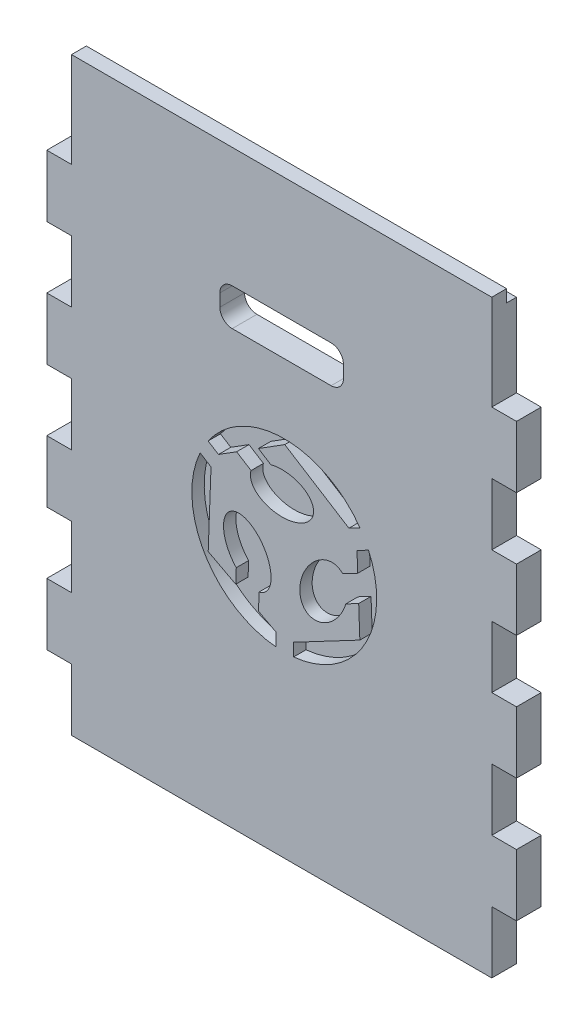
ISO-10303-21;
HEADER;
FILE_DESCRIPTION(('STEP AP214'),'2;1');
FILE_NAME('part.step','',(''),(''),'','','');
FILE_SCHEMA(('AUTOMOTIVE_DESIGN { 1 0 10303 214 1 1 1 1 }'));
ENDSEC;
DATA;
#1=APPLICATION_CONTEXT('core data for automotive mechanical design processes');
#2=APPLICATION_PROTOCOL_DEFINITION('international standard','automotive_design',2000,#1);
#3=PRODUCT_CONTEXT('',#1,'mechanical');
#4=PRODUCT('Part','Part','',(#3));
#5=PRODUCT_RELATED_PRODUCT_CATEGORY('part','',(#4));
#6=PRODUCT_DEFINITION_FORMATION('','',#4);
#7=PRODUCT_DEFINITION_CONTEXT('part definition',#1,'design');
#8=PRODUCT_DEFINITION('design','',#6,#7);
#9=PRODUCT_DEFINITION_SHAPE('','',#8);
#10=(LENGTH_UNIT() NAMED_UNIT(*) SI_UNIT(.MILLI.,.METRE.));
#11=(NAMED_UNIT(*) PLANE_ANGLE_UNIT() SI_UNIT($,.RADIAN.));
#12=(NAMED_UNIT(*) SI_UNIT($,.STERADIAN.) SOLID_ANGLE_UNIT());
#13=UNCERTAINTY_MEASURE_WITH_UNIT(LENGTH_MEASURE(1.E-05),#10,'distance_accuracy_value','');
#14=(GEOMETRIC_REPRESENTATION_CONTEXT(3) GLOBAL_UNCERTAINTY_ASSIGNED_CONTEXT((#13)) GLOBAL_UNIT_ASSIGNED_CONTEXT((#10,
#11,#12)) REPRESENTATION_CONTEXT('',''));
#15=CARTESIAN_POINT('',(0.,0.,0.));
#16=DIRECTION('',(0.,0.,1.));
#17=DIRECTION('',(1.,0.,0.));
#18=AXIS2_PLACEMENT_3D('',#15,#16,#17);
#19=CARTESIAN_POINT('',(19.9999999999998,477.,20.));
#20=DIRECTION('',(0.,-1.,0.));
#21=DIRECTION('',(0.,0.,-1.));
#22=AXIS2_PLACEMENT_3D('',#19,#20,#21);
#23=PLANE('',#22);
#24=DIRECTION('',(1.,0.,0.));
#25=VECTOR('',#24,1.);
#26=CARTESIAN_POINT('',(360.,477.,8.));
#27=LINE('',#26,#25);
#28=CARTESIAN_POINT('',(19.9999999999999,477.,8.));
#29=VERTEX_POINT('',#28);
#30=CARTESIAN_POINT('',(360.,477.,8.));
#31=VERTEX_POINT('',#30);
#32=EDGE_CURVE('E497',#29,#31,#27,.T.);
#33=ORIENTED_EDGE('',*,*,#32,.F.);
#34=DIRECTION('',(0.,0.,-1.));
#35=VECTOR('',#34,1.);
#36=CARTESIAN_POINT('',(19.9999999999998,477.,20.));
#37=LINE('',#36,#35);
#38=CARTESIAN_POINT('',(19.9999999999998,477.,20.));
#39=VERTEX_POINT('',#38);
#40=EDGE_CURVE('E1024',#39,#29,#37,.T.);
#41=ORIENTED_EDGE('',*,*,#40,.F.);
#42=DIRECTION('',(-1.,0.,0.));
#43=VECTOR('',#42,1.);
#44=CARTESIAN_POINT('',(19.9999999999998,477.,20.));
#45=LINE('',#44,#43);
#46=CARTESIAN_POINT('',(360.,477.,20.));
#47=VERTEX_POINT('',#46);
#48=EDGE_CURVE('E1113',#47,#39,#45,.T.);
#49=ORIENTED_EDGE('',*,*,#48,.F.);
#50=DIRECTION('',(0.,0.,-1.));
#51=VECTOR('',#50,1.);
#52=CARTESIAN_POINT('',(360.,477.,20.));
#53=LINE('',#52,#51);
#54=EDGE_CURVE('E1027',#47,#31,#53,.T.);
#55=ORIENTED_EDGE('',*,*,#54,.T.);
#56=EDGE_LOOP('',(#33,#41,#49,#55));
#57=FACE_BOUND('',#56,.T.);
#58=ADVANCED_FACE('F31',(#57),#23,.F.);
#59=CARTESIAN_POINT('',(20.,0.,20.));
#60=DIRECTION('',(1.,0.,0.));
#61=DIRECTION('',(0.,0.,-1.));
#62=AXIS2_PLACEMENT_3D('',#59,#60,#61);
#63=PLANE('',#62);
#64=DIRECTION('',(0.,-1.,0.));
#65=VECTOR('',#64,1.);
#66=CARTESIAN_POINT('',(20.,0.,0.));
#67=LINE('',#66,#65);
#68=CARTESIAN_POINT('',(20.,50.,0.));
#69=VERTEX_POINT('',#68);
#70=CARTESIAN_POINT('',(20.,0.,0.));
#71=VERTEX_POINT('',#70);
#72=EDGE_CURVE('E899',#69,#71,#67,.T.);
#73=ORIENTED_EDGE('',*,*,#72,.T.);
#74=DIRECTION('',(0.,0.,-1.));
#75=VECTOR('',#74,1.);
#76=CARTESIAN_POINT('',(20.,0.,20.));
#77=LINE('',#76,#75);
#78=CARTESIAN_POINT('',(20.,0.,20.));
#79=VERTEX_POINT('',#78);
#80=EDGE_CURVE('E11',#79,#71,#77,.T.);
#81=ORIENTED_EDGE('',*,*,#80,.F.);
#82=DIRECTION('',(0.,-1.,0.));
#83=VECTOR('',#82,1.);
#84=CARTESIAN_POINT('',(20.,0.,20.));
#85=LINE('',#84,#83);
#86=CARTESIAN_POINT('',(20.,50.,20.));
#87=VERTEX_POINT('',#86);
#88=EDGE_CURVE('E974',#87,#79,#85,.T.);
#89=ORIENTED_EDGE('',*,*,#88,.F.);
#90=DIRECTION('',(0.,0.,-1.));
#91=VECTOR('',#90,1.);
#92=CARTESIAN_POINT('',(20.,50.,20.));
#93=LINE('',#92,#91);
#94=EDGE_CURVE('E975',#87,#69,#93,.T.);
#95=ORIENTED_EDGE('',*,*,#94,.T.);
#96=EDGE_LOOP('',(#73,#81,#89,#95));
#97=FACE_BOUND('',#96,.T.);
#98=ADVANCED_FACE('F33',(#97),#63,.F.);
#99=CARTESIAN_POINT('',(20.,0.,20.));
#100=DIRECTION('',(0.,1.,0.));
#101=DIRECTION('',(0.,0.,1.));
#102=AXIS2_PLACEMENT_3D('',#99,#100,#101);
#103=PLANE('',#102);
#104=DIRECTION('',(1.,0.,0.));
#105=VECTOR('',#104,1.);
#106=CARTESIAN_POINT('',(20.,0.,0.));
#107=LINE('',#106,#105);
#108=CARTESIAN_POINT('',(360.,0.,0.));
#109=VERTEX_POINT('',#108);
#110=EDGE_CURVE('E891',#71,#109,#107,.T.);
#111=ORIENTED_EDGE('',*,*,#110,.T.);
#112=DIRECTION('',(0.,0.,-1.));
#113=VECTOR('',#112,1.);
#114=CARTESIAN_POINT('',(360.,0.,20.));
#115=LINE('',#114,#113);
#116=CARTESIAN_POINT('',(360.,0.,20.));
#117=VERTEX_POINT('',#116);
#118=EDGE_CURVE('E39',#117,#109,#115,.T.);
#119=ORIENTED_EDGE('',*,*,#118,.F.);
#120=DIRECTION('',(1.,0.,0.));
#121=VECTOR('',#120,1.);
#122=CARTESIAN_POINT('',(20.,0.,20.));
#123=LINE('',#122,#121);
#124=EDGE_CURVE('E1082',#79,#117,#123,.T.);
#125=ORIENTED_EDGE('',*,*,#124,.F.);
#126=ORIENTED_EDGE('',*,*,#80,.T.);
#127=EDGE_LOOP('',(#111,#119,#125,#126));
#128=FACE_BOUND('',#127,.T.);
#129=ADVANCED_FACE('F882',(#128),#103,.F.);
#130=CARTESIAN_POINT('',(360.,50.,20.));
#131=DIRECTION('',(-1.,0.,0.));
#132=DIRECTION('',(0.,0.,1.));
#133=AXIS2_PLACEMENT_3D('',#130,#131,#132);
#134=PLANE('',#133);
#135=DIRECTION('',(0.,1.,0.));
#136=VECTOR('',#135,1.);
#137=CARTESIAN_POINT('',(360.,50.,0.));
#138=LINE('',#137,#136);
#139=CARTESIAN_POINT('',(360.,50.,0.));
#140=VERTEX_POINT('',#139);
#141=EDGE_CURVE('E898',#109,#140,#138,.T.);
#142=ORIENTED_EDGE('',*,*,#141,.T.);
#143=DIRECTION('',(0.,0.,-1.));
#144=VECTOR('',#143,1.);
#145=CARTESIAN_POINT('',(360.,50.,20.));
#146=LINE('',#145,#144);
#147=CARTESIAN_POINT('',(360.,50.,20.));
#148=VERTEX_POINT('',#147);
#149=EDGE_CURVE('E904',#148,#140,#146,.T.);
#150=ORIENTED_EDGE('',*,*,#149,.F.);
#151=DIRECTION('',(0.,1.,0.));
#152=VECTOR('',#151,1.);
#153=CARTESIAN_POINT('',(360.,50.,20.));
#154=LINE('',#153,#152);
#155=EDGE_CURVE('E903',#117,#148,#154,.T.);
#156=ORIENTED_EDGE('',*,*,#155,.F.);
#157=ORIENTED_EDGE('',*,*,#118,.T.);
#158=EDGE_LOOP('',(#142,#150,#156,#157));
#159=FACE_BOUND('',#158,.T.);
#160=ADVANCED_FACE('F879',(#159),#134,.F.);
#161=CARTESIAN_POINT('',(360.,50.,20.));
#162=DIRECTION('',(0.,1.,0.));
#163=DIRECTION('',(-1.,0.,0.));
#164=AXIS2_PLACEMENT_3D('',#161,#162,#163);
#165=PLANE('',#164);
#166=DIRECTION('',(1.,0.,0.));
#167=VECTOR('',#166,1.);
#168=CARTESIAN_POINT('',(360.,50.,0.));
#169=LINE('',#168,#167);
#170=CARTESIAN_POINT('',(380.,50.,0.));
#171=VERTEX_POINT('',#170);
#172=EDGE_CURVE('E908',#140,#171,#169,.T.);
#173=ORIENTED_EDGE('',*,*,#172,.T.);
#174=DIRECTION('',(0.,0.,-1.));
#175=VECTOR('',#174,1.);
#176=CARTESIAN_POINT('',(380.,50.,20.));
#177=LINE('',#176,#175);
#178=CARTESIAN_POINT('',(380.,50.,20.));
#179=VERTEX_POINT('',#178);
#180=EDGE_CURVE('E1070',#179,#171,#177,.T.);
#181=ORIENTED_EDGE('',*,*,#180,.F.);
#182=DIRECTION('',(1.,0.,0.));
#183=VECTOR('',#182,1.);
#184=CARTESIAN_POINT('',(360.,50.,20.));
#185=LINE('',#184,#183);
#186=EDGE_CURVE('E1075',#148,#179,#185,.T.);
#187=ORIENTED_EDGE('',*,*,#186,.F.);
#188=ORIENTED_EDGE('',*,*,#149,.T.);
#189=EDGE_LOOP('',(#173,#181,#187,#188));
#190=FACE_BOUND('',#189,.T.);
#191=ADVANCED_FACE('F875',(#190),#165,.F.);
#192=CARTESIAN_POINT('',(380.,50.,20.));
#193=DIRECTION('',(-1.,0.,0.));
#194=DIRECTION('',(0.,-1.,0.));
#195=AXIS2_PLACEMENT_3D('',#192,#193,#194);
#196=PLANE('',#195);
#197=DIRECTION('',(0.,1.,0.));
#198=VECTOR('',#197,1.);
#199=CARTESIAN_POINT('',(380.,50.,0.));
#200=LINE('',#199,#198);
#201=CARTESIAN_POINT('',(380.,100.,0.));
#202=VERTEX_POINT('',#201);
#203=EDGE_CURVE('E910',#171,#202,#200,.T.);
#204=ORIENTED_EDGE('',*,*,#203,.T.);
#205=DIRECTION('',(0.,0.,-1.));
#206=VECTOR('',#205,1.);
#207=CARTESIAN_POINT('',(380.,100.,20.));
#208=LINE('',#207,#206);
#209=CARTESIAN_POINT('',(380.,100.,20.));
#210=VERTEX_POINT('',#209);
#211=EDGE_CURVE('E1067',#210,#202,#208,.T.);
#212=ORIENTED_EDGE('',*,*,#211,.F.);
#213=DIRECTION('',(0.,1.,0.));
#214=VECTOR('',#213,1.);
#215=CARTESIAN_POINT('',(380.,50.,20.));
#216=LINE('',#215,#214);
#217=EDGE_CURVE('E1078',#179,#210,#216,.T.);
#218=ORIENTED_EDGE('',*,*,#217,.F.);
#219=ORIENTED_EDGE('',*,*,#180,.T.);
#220=EDGE_LOOP('',(#204,#212,#218,#219));
#221=FACE_BOUND('',#220,.T.);
#222=ADVANCED_FACE('F871',(#221),#196,.F.);
#223=CARTESIAN_POINT('',(360.,100.,20.));
#224=DIRECTION('',(0.,-1.,0.));
#225=DIRECTION('',(1.,0.,0.));
#226=AXIS2_PLACEMENT_3D('',#223,#224,#225);
#227=PLANE('',#226);
#228=DIRECTION('',(-1.,0.,0.));
#229=VECTOR('',#228,1.);
#230=CARTESIAN_POINT('',(360.,100.,0.));
#231=LINE('',#230,#229);
#232=CARTESIAN_POINT('',(360.,100.,0.));
#233=VERTEX_POINT('',#232);
#234=EDGE_CURVE('E915',#202,#233,#231,.T.);
#235=ORIENTED_EDGE('',*,*,#234,.T.);
#236=DIRECTION('',(0.,0.,-1.));
#237=VECTOR('',#236,1.);
#238=CARTESIAN_POINT('',(360.,100.,20.));
#239=LINE('',#238,#237);
#240=CARTESIAN_POINT('',(360.,100.,20.));
#241=VERTEX_POINT('',#240);
#242=EDGE_CURVE('E1064',#241,#233,#239,.T.);
#243=ORIENTED_EDGE('',*,*,#242,.F.);
#244=DIRECTION('',(-1.,0.,0.));
#245=VECTOR('',#244,1.);
#246=CARTESIAN_POINT('',(360.,100.,20.));
#247=LINE('',#246,#245);
#248=EDGE_CURVE('E1080',#210,#241,#247,.T.);
#249=ORIENTED_EDGE('',*,*,#248,.F.);
#250=ORIENTED_EDGE('',*,*,#211,.T.);
#251=EDGE_LOOP('',(#235,#243,#249,#250));
#252=FACE_BOUND('',#251,.T.);
#253=ADVANCED_FACE('F867',(#252),#227,.F.);
#254=CARTESIAN_POINT('',(360.,150.,20.));
#255=DIRECTION('',(-1.,0.,0.));
#256=DIRECTION('',(0.,0.,1.));
#257=AXIS2_PLACEMENT_3D('',#254,#255,#256);
#258=PLANE('',#257);
#259=DIRECTION('',(0.,1.,0.));
#260=VECTOR('',#259,1.);
#261=CARTESIAN_POINT('',(360.,150.,0.));
#262=LINE('',#261,#260);
#263=CARTESIAN_POINT('',(360.,150.,0.));
#264=VERTEX_POINT('',#263);
#265=EDGE_CURVE('E917',#233,#264,#262,.T.);
#266=ORIENTED_EDGE('',*,*,#265,.T.);
#267=DIRECTION('',(0.,0.,-1.));
#268=VECTOR('',#267,1.);
#269=CARTESIAN_POINT('',(360.,150.,20.));
#270=LINE('',#269,#268);
#271=CARTESIAN_POINT('',(360.,150.,20.));
#272=VERTEX_POINT('',#271);
#273=EDGE_CURVE('E1061',#272,#264,#270,.T.);
#274=ORIENTED_EDGE('',*,*,#273,.F.);
#275=DIRECTION('',(0.,1.,0.));
#276=VECTOR('',#275,1.);
#277=CARTESIAN_POINT('',(360.,150.,20.));
#278=LINE('',#277,#276);
#279=EDGE_CURVE('E1087',#241,#272,#278,.T.);
#280=ORIENTED_EDGE('',*,*,#279,.F.);
#281=ORIENTED_EDGE('',*,*,#242,.T.);
#282=EDGE_LOOP('',(#266,#274,#280,#281));
#283=FACE_BOUND('',#282,.T.);
#284=ADVANCED_FACE('F863',(#283),#258,.F.);
#285=CARTESIAN_POINT('',(360.,150.,20.));
#286=DIRECTION('',(0.,1.,0.));
#287=DIRECTION('',(0.,0.,1.));
#288=AXIS2_PLACEMENT_3D('',#285,#286,#287);
#289=PLANE('',#288);
#290=DIRECTION('',(1.,0.,0.));
#291=VECTOR('',#290,1.);
#292=CARTESIAN_POINT('',(360.,150.,0.));
#293=LINE('',#292,#291);
#294=CARTESIAN_POINT('',(379.999999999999,150.,0.));
#295=VERTEX_POINT('',#294);
#296=EDGE_CURVE('E919',#264,#295,#293,.T.);
#297=ORIENTED_EDGE('',*,*,#296,.T.);
#298=DIRECTION('',(0.,0.,-1.));
#299=VECTOR('',#298,1.);
#300=CARTESIAN_POINT('',(379.999999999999,150.,20.));
#301=LINE('',#300,#299);
#302=CARTESIAN_POINT('',(379.999999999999,150.,20.));
#303=VERTEX_POINT('',#302);
#304=EDGE_CURVE('E1058',#303,#295,#301,.T.);
#305=ORIENTED_EDGE('',*,*,#304,.F.);
#306=DIRECTION('',(1.,0.,0.));
#307=VECTOR('',#306,1.);
#308=CARTESIAN_POINT('',(360.,150.,20.));
#309=LINE('',#308,#307);
#310=EDGE_CURVE('E1089',#272,#303,#309,.T.);
#311=ORIENTED_EDGE('',*,*,#310,.F.);
#312=ORIENTED_EDGE('',*,*,#273,.T.);
#313=EDGE_LOOP('',(#297,#305,#311,#312));
#314=FACE_BOUND('',#313,.T.);
#315=ADVANCED_FACE('F859',(#314),#289,.F.);
#316=CARTESIAN_POINT('',(379.999999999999,150.,20.));
#317=DIRECTION('',(-1.,0.,0.));
#318=DIRECTION('',(0.,-1.,0.));
#319=AXIS2_PLACEMENT_3D('',#316,#317,#318);
#320=PLANE('',#319);
#321=DIRECTION('',(0.,1.,0.));
#322=VECTOR('',#321,1.);
#323=CARTESIAN_POINT('',(379.999999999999,150.,0.));
#324=LINE('',#323,#322);
#325=CARTESIAN_POINT('',(379.999999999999,200.,0.));
#326=VERTEX_POINT('',#325);
#327=EDGE_CURVE('E921',#295,#326,#324,.T.);
#328=ORIENTED_EDGE('',*,*,#327,.T.);
#329=DIRECTION('',(0.,0.,-1.));
#330=VECTOR('',#329,1.);
#331=CARTESIAN_POINT('',(379.999999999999,200.,20.));
#332=LINE('',#331,#330);
#333=CARTESIAN_POINT('',(379.999999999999,200.,20.));
#334=VERTEX_POINT('',#333);
#335=EDGE_CURVE('E1055',#334,#326,#332,.T.);
#336=ORIENTED_EDGE('',*,*,#335,.F.);
#337=DIRECTION('',(0.,1.,0.));
#338=VECTOR('',#337,1.);
#339=CARTESIAN_POINT('',(379.999999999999,150.,20.));
#340=LINE('',#339,#338);
#341=EDGE_CURVE('E1091',#303,#334,#340,.T.);
#342=ORIENTED_EDGE('',*,*,#341,.F.);
#343=ORIENTED_EDGE('',*,*,#304,.T.);
#344=EDGE_LOOP('',(#328,#336,#342,#343));
#345=FACE_BOUND('',#344,.T.);
#346=ADVANCED_FACE('F855',(#345),#320,.F.);
#347=CARTESIAN_POINT('',(360.,200.,20.));
#348=DIRECTION('',(0.,-1.,0.));
#349=DIRECTION('',(0.,0.,-1.));
#350=AXIS2_PLACEMENT_3D('',#347,#348,#349);
#351=PLANE('',#350);
#352=DIRECTION('',(-1.,0.,0.));
#353=VECTOR('',#352,1.);
#354=CARTESIAN_POINT('',(360.,200.,0.));
#355=LINE('',#354,#353);
#356=CARTESIAN_POINT('',(360.,200.,0.));
#357=VERTEX_POINT('',#356);
#358=EDGE_CURVE('E923',#326,#357,#355,.T.);
#359=ORIENTED_EDGE('',*,*,#358,.T.);
#360=DIRECTION('',(0.,0.,-1.));
#361=VECTOR('',#360,1.);
#362=CARTESIAN_POINT('',(360.,200.,20.));
#363=LINE('',#362,#361);
#364=CARTESIAN_POINT('',(360.,200.,20.));
#365=VERTEX_POINT('',#364);
#366=EDGE_CURVE('E1052',#365,#357,#363,.T.);
#367=ORIENTED_EDGE('',*,*,#366,.F.);
#368=DIRECTION('',(-1.,0.,0.));
#369=VECTOR('',#368,1.);
#370=CARTESIAN_POINT('',(360.,200.,20.));
#371=LINE('',#370,#369);
#372=EDGE_CURVE('E1093',#334,#365,#371,.T.);
#373=ORIENTED_EDGE('',*,*,#372,.F.);
#374=ORIENTED_EDGE('',*,*,#335,.T.);
#375=EDGE_LOOP('',(#359,#367,#373,#374));
#376=FACE_BOUND('',#375,.T.);
#377=ADVANCED_FACE('F851',(#376),#351,.F.);
#378=CARTESIAN_POINT('',(360.,250.,20.));
#379=DIRECTION('',(-1.,0.,0.));
#380=DIRECTION('',(0.,-1.,0.));
#381=AXIS2_PLACEMENT_3D('',#378,#379,#380);
#382=PLANE('',#381);
#383=DIRECTION('',(0.,1.,0.));
#384=VECTOR('',#383,1.);
#385=CARTESIAN_POINT('',(360.,250.,0.));
#386=LINE('',#385,#384);
#387=CARTESIAN_POINT('',(360.,250.,0.));
#388=VERTEX_POINT('',#387);
#389=EDGE_CURVE('E925',#357,#388,#386,.T.);
#390=ORIENTED_EDGE('',*,*,#389,.T.);
#391=DIRECTION('',(0.,0.,-1.));
#392=VECTOR('',#391,1.);
#393=CARTESIAN_POINT('',(360.,250.,20.));
#394=LINE('',#393,#392);
#395=CARTESIAN_POINT('',(360.,250.,20.));
#396=VERTEX_POINT('',#395);
#397=EDGE_CURVE('E1049',#396,#388,#394,.T.);
#398=ORIENTED_EDGE('',*,*,#397,.F.);
#399=DIRECTION('',(0.,1.,0.));
#400=VECTOR('',#399,1.);
#401=CARTESIAN_POINT('',(360.,250.,20.));
#402=LINE('',#401,#400);
#403=EDGE_CURVE('E1095',#365,#396,#402,.T.);
#404=ORIENTED_EDGE('',*,*,#403,.F.);
#405=ORIENTED_EDGE('',*,*,#366,.T.);
#406=EDGE_LOOP('',(#390,#398,#404,#405));
#407=FACE_BOUND('',#406,.T.);
#408=ADVANCED_FACE('F847',(#407),#382,.F.);
#409=CARTESIAN_POINT('',(360.,250.,20.));
#410=DIRECTION('',(0.,1.,0.));
#411=DIRECTION('',(0.,0.,1.));
#412=AXIS2_PLACEMENT_3D('',#409,#410,#411);
#413=PLANE('',#412);
#414=DIRECTION('',(1.,0.,0.));
#415=VECTOR('',#414,1.);
#416=CARTESIAN_POINT('',(360.,250.,0.));
#417=LINE('',#416,#415);
#418=CARTESIAN_POINT('',(379.999999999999,250.,0.));
#419=VERTEX_POINT('',#418);
#420=EDGE_CURVE('E927',#388,#419,#417,.T.);
#421=ORIENTED_EDGE('',*,*,#420,.T.);
#422=DIRECTION('',(0.,0.,-1.));
#423=VECTOR('',#422,1.);
#424=CARTESIAN_POINT('',(379.999999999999,250.,20.));
#425=LINE('',#424,#423);
#426=CARTESIAN_POINT('',(379.999999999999,250.,20.));
#427=VERTEX_POINT('',#426);
#428=EDGE_CURVE('E1046',#427,#419,#425,.T.);
#429=ORIENTED_EDGE('',*,*,#428,.F.);
#430=DIRECTION('',(1.,0.,0.));
#431=VECTOR('',#430,1.);
#432=CARTESIAN_POINT('',(360.,250.,20.));
#433=LINE('',#432,#431);
#434=EDGE_CURVE('E1097',#396,#427,#433,.T.);
#435=ORIENTED_EDGE('',*,*,#434,.F.);
#436=ORIENTED_EDGE('',*,*,#397,.T.);
#437=EDGE_LOOP('',(#421,#429,#435,#436));
#438=FACE_BOUND('',#437,.T.);
#439=ADVANCED_FACE('F843',(#438),#413,.F.);
#440=CARTESIAN_POINT('',(379.999999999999,250.,20.));
#441=DIRECTION('',(-1.,0.,0.));
#442=DIRECTION('',(0.,-1.,0.));
#443=AXIS2_PLACEMENT_3D('',#440,#441,#442);
#444=PLANE('',#443);
#445=DIRECTION('',(0.,1.,0.));
#446=VECTOR('',#445,1.);
#447=CARTESIAN_POINT('',(379.999999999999,250.,0.));
#448=LINE('',#447,#446);
#449=CARTESIAN_POINT('',(379.999999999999,300.,0.));
#450=VERTEX_POINT('',#449);
#451=EDGE_CURVE('E929',#419,#450,#448,.T.);
#452=ORIENTED_EDGE('',*,*,#451,.T.);
#453=DIRECTION('',(0.,0.,-1.));
#454=VECTOR('',#453,1.);
#455=CARTESIAN_POINT('',(379.999999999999,300.,20.));
#456=LINE('',#455,#454);
#457=CARTESIAN_POINT('',(379.999999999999,300.,20.));
#458=VERTEX_POINT('',#457);
#459=EDGE_CURVE('E1043',#458,#450,#456,.T.);
#460=ORIENTED_EDGE('',*,*,#459,.F.);
#461=DIRECTION('',(0.,1.,0.));
#462=VECTOR('',#461,1.);
#463=CARTESIAN_POINT('',(379.999999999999,250.,20.));
#464=LINE('',#463,#462);
#465=EDGE_CURVE('E1099',#427,#458,#464,.T.);
#466=ORIENTED_EDGE('',*,*,#465,.F.);
#467=ORIENTED_EDGE('',*,*,#428,.T.);
#468=EDGE_LOOP('',(#452,#460,#466,#467));
#469=FACE_BOUND('',#468,.T.);
#470=ADVANCED_FACE('F839',(#469),#444,.F.);
#471=CARTESIAN_POINT('',(360.,300.,20.));
#472=DIRECTION('',(0.,-1.,0.));
#473=DIRECTION('',(0.,0.,-1.));
#474=AXIS2_PLACEMENT_3D('',#471,#472,#473);
#475=PLANE('',#474);
#476=DIRECTION('',(-1.,0.,0.));
#477=VECTOR('',#476,1.);
#478=CARTESIAN_POINT('',(360.,300.,0.));
#479=LINE('',#478,#477);
#480=CARTESIAN_POINT('',(360.,300.,0.));
#481=VERTEX_POINT('',#480);
#482=EDGE_CURVE('E931',#450,#481,#479,.T.);
#483=ORIENTED_EDGE('',*,*,#482,.T.);
#484=DIRECTION('',(0.,0.,-1.));
#485=VECTOR('',#484,1.);
#486=CARTESIAN_POINT('',(360.,300.,20.));
#487=LINE('',#486,#485);
#488=CARTESIAN_POINT('',(360.,300.,20.));
#489=VERTEX_POINT('',#488);
#490=EDGE_CURVE('E1040',#489,#481,#487,.T.);
#491=ORIENTED_EDGE('',*,*,#490,.F.);
#492=DIRECTION('',(-1.,0.,0.));
#493=VECTOR('',#492,1.);
#494=CARTESIAN_POINT('',(360.,300.,20.));
#495=LINE('',#494,#493);
#496=EDGE_CURVE('E1101',#458,#489,#495,.T.);
#497=ORIENTED_EDGE('',*,*,#496,.F.);
#498=ORIENTED_EDGE('',*,*,#459,.T.);
#499=EDGE_LOOP('',(#483,#491,#497,#498));
#500=FACE_BOUND('',#499,.T.);
#501=ADVANCED_FACE('F835',(#500),#475,.F.);
#502=CARTESIAN_POINT('',(360.,350.,20.));
#503=DIRECTION('',(-1.,0.,0.));
#504=DIRECTION('',(0.,0.,1.));
#505=AXIS2_PLACEMENT_3D('',#502,#503,#504);
#506=PLANE('',#505);
#507=DIRECTION('',(0.,1.,0.));
#508=VECTOR('',#507,1.);
#509=CARTESIAN_POINT('',(360.,350.,0.));
#510=LINE('',#509,#508);
#511=CARTESIAN_POINT('',(360.,350.,0.));
#512=VERTEX_POINT('',#511);
#513=EDGE_CURVE('E933',#481,#512,#510,.T.);
#514=ORIENTED_EDGE('',*,*,#513,.T.);
#515=DIRECTION('',(0.,0.,-1.));
#516=VECTOR('',#515,1.);
#517=CARTESIAN_POINT('',(360.,350.,20.));
#518=LINE('',#517,#516);
#519=CARTESIAN_POINT('',(360.,350.,20.));
#520=VERTEX_POINT('',#519);
#521=EDGE_CURVE('E1037',#520,#512,#518,.T.);
#522=ORIENTED_EDGE('',*,*,#521,.F.);
#523=DIRECTION('',(0.,1.,0.));
#524=VECTOR('',#523,1.);
#525=CARTESIAN_POINT('',(360.,350.,20.));
#526=LINE('',#525,#524);
#527=EDGE_CURVE('E1103',#489,#520,#526,.T.);
#528=ORIENTED_EDGE('',*,*,#527,.F.);
#529=ORIENTED_EDGE('',*,*,#490,.T.);
#530=EDGE_LOOP('',(#514,#522,#528,#529));
#531=FACE_BOUND('',#530,.T.);
#532=ADVANCED_FACE('F831',(#531),#506,.F.);
#533=CARTESIAN_POINT('',(360.,350.,20.));
#534=DIRECTION('',(0.,1.,0.));
#535=DIRECTION('',(0.,0.,1.));
#536=AXIS2_PLACEMENT_3D('',#533,#534,#535);
#537=PLANE('',#536);
#538=DIRECTION('',(1.,0.,0.));
#539=VECTOR('',#538,1.);
#540=CARTESIAN_POINT('',(360.,350.,0.));
#541=LINE('',#540,#539);
#542=CARTESIAN_POINT('',(379.999999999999,350.,0.));
#543=VERTEX_POINT('',#542);
#544=EDGE_CURVE('E935',#512,#543,#541,.T.);
#545=ORIENTED_EDGE('',*,*,#544,.T.);
#546=DIRECTION('',(0.,0.,-1.));
#547=VECTOR('',#546,1.);
#548=CARTESIAN_POINT('',(379.999999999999,350.,20.));
#549=LINE('',#548,#547);
#550=CARTESIAN_POINT('',(379.999999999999,350.,20.));
#551=VERTEX_POINT('',#550);
#552=EDGE_CURVE('E1034',#551,#543,#549,.T.);
#553=ORIENTED_EDGE('',*,*,#552,.F.);
#554=DIRECTION('',(1.,0.,0.));
#555=VECTOR('',#554,1.);
#556=CARTESIAN_POINT('',(360.,350.,20.));
#557=LINE('',#556,#555);
#558=EDGE_CURVE('E1105',#520,#551,#557,.T.);
#559=ORIENTED_EDGE('',*,*,#558,.F.);
#560=ORIENTED_EDGE('',*,*,#521,.T.);
#561=EDGE_LOOP('',(#545,#553,#559,#560));
#562=FACE_BOUND('',#561,.T.);
#563=ADVANCED_FACE('F827',(#562),#537,.F.);
#564=CARTESIAN_POINT('',(379.999999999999,350.,20.));
#565=DIRECTION('',(-1.,0.,0.));
#566=DIRECTION('',(0.,-1.,0.));
#567=AXIS2_PLACEMENT_3D('',#564,#565,#566);
#568=PLANE('',#567);
#569=DIRECTION('',(0.,1.,0.));
#570=VECTOR('',#569,1.);
#571=CARTESIAN_POINT('',(379.999999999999,350.,0.));
#572=LINE('',#571,#570);
#573=CARTESIAN_POINT('',(379.999999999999,400.,0.));
#574=VERTEX_POINT('',#573);
#575=EDGE_CURVE('E937',#543,#574,#572,.T.);
#576=ORIENTED_EDGE('',*,*,#575,.T.);
#577=DIRECTION('',(0.,0.,-1.));
#578=VECTOR('',#577,1.);
#579=CARTESIAN_POINT('',(379.999999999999,400.,20.));
#580=LINE('',#579,#578);
#581=CARTESIAN_POINT('',(379.999999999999,400.,20.));
#582=VERTEX_POINT('',#581);
#583=EDGE_CURVE('E1031',#582,#574,#580,.T.);
#584=ORIENTED_EDGE('',*,*,#583,.F.);
#585=DIRECTION('',(0.,1.,0.));
#586=VECTOR('',#585,1.);
#587=CARTESIAN_POINT('',(379.999999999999,350.,20.));
#588=LINE('',#587,#586);
#589=EDGE_CURVE('E1107',#551,#582,#588,.T.);
#590=ORIENTED_EDGE('',*,*,#589,.F.);
#591=ORIENTED_EDGE('',*,*,#552,.T.);
#592=EDGE_LOOP('',(#576,#584,#590,#591));
#593=FACE_BOUND('',#592,.T.);
#594=ADVANCED_FACE('F823',(#593),#568,.F.);
#595=CARTESIAN_POINT('',(360.,400.,20.));
#596=DIRECTION('',(0.,-1.,0.));
#597=DIRECTION('',(0.,0.,-1.));
#598=AXIS2_PLACEMENT_3D('',#595,#596,#597);
#599=PLANE('',#598);
#600=DIRECTION('',(-1.,0.,0.));
#601=VECTOR('',#600,1.);
#602=CARTESIAN_POINT('',(360.,400.,0.));
#603=LINE('',#602,#601);
#604=CARTESIAN_POINT('',(360.,400.,0.));
#605=VERTEX_POINT('',#604);
#606=EDGE_CURVE('E939',#574,#605,#603,.T.);
#607=ORIENTED_EDGE('',*,*,#606,.T.);
#608=DIRECTION('',(0.,0.,-1.));
#609=VECTOR('',#608,1.);
#610=CARTESIAN_POINT('',(360.,400.,20.));
#611=LINE('',#610,#609);
#612=CARTESIAN_POINT('',(360.,400.,20.));
#613=VERTEX_POINT('',#612);
#614=EDGE_CURVE('E1029',#613,#605,#611,.T.);
#615=ORIENTED_EDGE('',*,*,#614,.F.);
#616=DIRECTION('',(-1.,0.,0.));
#617=VECTOR('',#616,1.);
#618=CARTESIAN_POINT('',(360.,400.,20.));
#619=LINE('',#618,#617);
#620=EDGE_CURVE('E1109',#582,#613,#619,.T.);
#621=ORIENTED_EDGE('',*,*,#620,.F.);
#622=ORIENTED_EDGE('',*,*,#583,.T.);
#623=EDGE_LOOP('',(#607,#615,#621,#622));
#624=FACE_BOUND('',#623,.T.);
#625=ADVANCED_FACE('F820',(#624),#599,.F.);
#626=CARTESIAN_POINT('',(360.,477.,20.));
#627=DIRECTION('',(-1.,0.,0.));
#628=DIRECTION('',(0.,0.,1.));
#629=AXIS2_PLACEMENT_3D('',#626,#627,#628);
#630=PLANE('',#629);
#631=DIRECTION('',(0.,1.,0.));
#632=VECTOR('',#631,1.);
#633=CARTESIAN_POINT('',(360.,477.,0.));
#634=LINE('',#633,#632);
#635=CARTESIAN_POINT('',(360.,467.,0.));
#636=VERTEX_POINT('',#635);
#637=EDGE_CURVE('E507',#605,#636,#634,.T.);
#638=ORIENTED_EDGE('',*,*,#637,.T.);
#639=DIRECTION('',(0.,0.,-1.));
#640=VECTOR('',#639,1.);
#641=CARTESIAN_POINT('',(360.,467.,8.));
#642=LINE('',#641,#640);
#643=CARTESIAN_POINT('',(360.,467.,8.));
#644=VERTEX_POINT('',#643);
#645=EDGE_CURVE('E46',#644,#636,#642,.T.);
#646=ORIENTED_EDGE('',*,*,#645,.F.);
#647=DIRECTION('',(0.,-1.,0.));
#648=VECTOR('',#647,1.);
#649=CARTESIAN_POINT('',(360.,477.,8.));
#650=LINE('',#649,#648);
#651=EDGE_CURVE('E492',#31,#644,#650,.T.);
#652=ORIENTED_EDGE('',*,*,#651,.F.);
#653=ORIENTED_EDGE('',*,*,#54,.F.);
#654=DIRECTION('',(0.,1.,0.));
#655=VECTOR('',#654,1.);
#656=CARTESIAN_POINT('',(360.,477.,20.));
#657=LINE('',#656,#655);
#658=EDGE_CURVE('E1111',#613,#47,#657,.T.);
#659=ORIENTED_EDGE('',*,*,#658,.F.);
#660=ORIENTED_EDGE('',*,*,#614,.T.);
#661=EDGE_LOOP('',(#638,#646,#652,#653,#659,#660));
#662=FACE_BOUND('',#661,.T.);
#663=ADVANCED_FACE('F504',(#662),#630,.F.);
#664=CARTESIAN_POINT('',(20.,400.,20.));
#665=DIRECTION('',(1.,0.,0.));
#666=DIRECTION('',(0.,1.,0.));
#667=AXIS2_PLACEMENT_3D('',#664,#665,#666);
#668=PLANE('',#667);
#669=DIRECTION('',(0.,1.,0.));
#670=VECTOR('',#669,1.);
#671=CARTESIAN_POINT('',(19.9999999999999,477.,8.));
#672=LINE('',#671,#670);
#673=CARTESIAN_POINT('',(19.9999999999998,467.,8.));
#674=VERTEX_POINT('',#673);
#675=EDGE_CURVE('E491',#674,#29,#672,.T.);
#676=ORIENTED_EDGE('',*,*,#675,.F.);
#677=DIRECTION('',(0.,0.,-1.));
#678=VECTOR('',#677,1.);
#679=CARTESIAN_POINT('',(19.9999999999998,467.,8.));
#680=LINE('',#679,#678);
#681=CARTESIAN_POINT('',(19.9999999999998,467.,0.));
#682=VERTEX_POINT('',#681);
#683=EDGE_CURVE('E488',#674,#682,#680,.T.);
#684=ORIENTED_EDGE('',*,*,#683,.T.);
#685=DIRECTION('',(0.,-1.,0.));
#686=VECTOR('',#685,1.);
#687=CARTESIAN_POINT('',(20.,400.,0.));
#688=LINE('',#687,#686);
#689=CARTESIAN_POINT('',(20.,400.,0.));
#690=VERTEX_POINT('',#689);
#691=EDGE_CURVE('E942',#682,#690,#688,.T.);
#692=ORIENTED_EDGE('',*,*,#691,.T.);
#693=DIRECTION('',(0.,0.,-1.));
#694=VECTOR('',#693,1.);
#695=CARTESIAN_POINT('',(20.,400.,20.));
#696=LINE('',#695,#694);
#697=CARTESIAN_POINT('',(20.,400.,20.));
#698=VERTEX_POINT('',#697);
#699=EDGE_CURVE('E1021',#698,#690,#696,.T.);
#700=ORIENTED_EDGE('',*,*,#699,.F.);
#701=DIRECTION('',(0.,-1.,0.));
#702=VECTOR('',#701,1.);
#703=CARTESIAN_POINT('',(20.,400.,20.));
#704=LINE('',#703,#702);
#705=EDGE_CURVE('E1115',#39,#698,#704,.T.);
#706=ORIENTED_EDGE('',*,*,#705,.F.);
#707=ORIENTED_EDGE('',*,*,#40,.T.);
#708=EDGE_LOOP('',(#676,#684,#692,#700,#706,#707));
#709=FACE_BOUND('',#708,.T.);
#710=ADVANCED_FACE('F810',(#709),#668,.F.);
#711=CARTESIAN_POINT('',(-1.39659334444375E-12,400.,20.));
#712=DIRECTION('',(0.,-1.,0.));
#713=DIRECTION('',(0.,0.,-1.));
#714=AXIS2_PLACEMENT_3D('',#711,#712,#713);
#715=PLANE('',#714);
#716=DIRECTION('',(-1.,0.,0.));
#717=VECTOR('',#716,1.);
#718=CARTESIAN_POINT('',(-1.39659334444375E-12,400.,0.));
#719=LINE('',#718,#717);
#720=CARTESIAN_POINT('',(-1.39659334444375E-12,400.,0.));
#721=VERTEX_POINT('',#720);
#722=EDGE_CURVE('E944',#690,#721,#719,.T.);
#723=ORIENTED_EDGE('',*,*,#722,.T.);
#724=DIRECTION('',(0.,0.,-1.));
#725=VECTOR('',#724,1.);
#726=CARTESIAN_POINT('',(-1.39659334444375E-12,400.,20.));
#727=LINE('',#726,#725);
#728=CARTESIAN_POINT('',(-1.39659334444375E-12,400.,20.));
#729=VERTEX_POINT('',#728);
#730=EDGE_CURVE('E1018',#729,#721,#727,.T.);
#731=ORIENTED_EDGE('',*,*,#730,.F.);
#732=DIRECTION('',(-1.,0.,0.));
#733=VECTOR('',#732,1.);
#734=CARTESIAN_POINT('',(-1.39659334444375E-12,400.,20.));
#735=LINE('',#734,#733);
#736=EDGE_CURVE('E1117',#698,#729,#735,.T.);
#737=ORIENTED_EDGE('',*,*,#736,.F.);
#738=ORIENTED_EDGE('',*,*,#699,.T.);
#739=EDGE_LOOP('',(#723,#731,#737,#738));
#740=FACE_BOUND('',#739,.T.);
#741=ADVANCED_FACE('F806',(#740),#715,.F.);
#742=CARTESIAN_POINT('',(-1.22201917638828E-12,350.,20.));
#743=DIRECTION('',(1.,0.,0.));
#744=DIRECTION('',(0.,1.,0.));
#745=AXIS2_PLACEMENT_3D('',#742,#743,#744);
#746=PLANE('',#745);
#747=DIRECTION('',(0.,-1.,0.));
#748=VECTOR('',#747,1.);
#749=CARTESIAN_POINT('',(-1.22201917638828E-12,350.,0.));
#750=LINE('',#749,#748);
#751=CARTESIAN_POINT('',(-1.22201917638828E-12,350.,0.));
#752=VERTEX_POINT('',#751);
#753=EDGE_CURVE('E946',#721,#752,#750,.T.);
#754=ORIENTED_EDGE('',*,*,#753,.T.);
#755=DIRECTION('',(0.,0.,-1.));
#756=VECTOR('',#755,1.);
#757=CARTESIAN_POINT('',(-1.22201917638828E-12,350.,20.));
#758=LINE('',#757,#756);
#759=CARTESIAN_POINT('',(-1.22201917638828E-12,350.,20.));
#760=VERTEX_POINT('',#759);
#761=EDGE_CURVE('E1015',#760,#752,#758,.T.);
#762=ORIENTED_EDGE('',*,*,#761,.F.);
#763=DIRECTION('',(0.,-1.,0.));
#764=VECTOR('',#763,1.);
#765=CARTESIAN_POINT('',(-1.22201917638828E-12,350.,20.));
#766=LINE('',#765,#764);
#767=EDGE_CURVE('E1119',#729,#760,#766,.T.);
#768=ORIENTED_EDGE('',*,*,#767,.F.);
#769=ORIENTED_EDGE('',*,*,#730,.T.);
#770=EDGE_LOOP('',(#754,#762,#768,#769));
#771=FACE_BOUND('',#770,.T.);
#772=ADVANCED_FACE('F802',(#771),#746,.F.);
#773=CARTESIAN_POINT('',(-1.22201917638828E-12,350.,20.));
#774=DIRECTION('',(0.,1.,0.));
#775=DIRECTION('',(0.,0.,1.));
#776=AXIS2_PLACEMENT_3D('',#773,#774,#775);
#777=PLANE('',#776);
#778=DIRECTION('',(1.,0.,0.));
#779=VECTOR('',#778,1.);
#780=CARTESIAN_POINT('',(-1.22201917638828E-12,350.,0.));
#781=LINE('',#780,#779);
#782=CARTESIAN_POINT('',(20.,350.,0.));
#783=VERTEX_POINT('',#782);
#784=EDGE_CURVE('E948',#752,#783,#781,.T.);
#785=ORIENTED_EDGE('',*,*,#784,.T.);
#786=DIRECTION('',(0.,0.,-1.));
#787=VECTOR('',#786,1.);
#788=CARTESIAN_POINT('',(20.,350.,20.));
#789=LINE('',#788,#787);
#790=CARTESIAN_POINT('',(20.,350.,20.));
#791=VERTEX_POINT('',#790);
#792=EDGE_CURVE('E1012',#791,#783,#789,.T.);
#793=ORIENTED_EDGE('',*,*,#792,.F.);
#794=DIRECTION('',(1.,0.,0.));
#795=VECTOR('',#794,1.);
#796=CARTESIAN_POINT('',(-1.22201917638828E-12,350.,20.));
#797=LINE('',#796,#795);
#798=EDGE_CURVE('E1121',#760,#791,#797,.T.);
#799=ORIENTED_EDGE('',*,*,#798,.F.);
#800=ORIENTED_EDGE('',*,*,#761,.T.);
#801=EDGE_LOOP('',(#785,#793,#799,#800));
#802=FACE_BOUND('',#801,.T.);
#803=ADVANCED_FACE('F798',(#802),#777,.F.);
#804=CARTESIAN_POINT('',(20.,300.,20.));
#805=DIRECTION('',(1.,0.,0.));
#806=DIRECTION('',(0.,0.,-1.));
#807=AXIS2_PLACEMENT_3D('',#804,#805,#806);
#808=PLANE('',#807);
#809=DIRECTION('',(0.,-1.,0.));
#810=VECTOR('',#809,1.);
#811=CARTESIAN_POINT('',(20.,300.,0.));
#812=LINE('',#811,#810);
#813=CARTESIAN_POINT('',(20.,300.,0.));
#814=VERTEX_POINT('',#813);
#815=EDGE_CURVE('E950',#783,#814,#812,.T.);
#816=ORIENTED_EDGE('',*,*,#815,.T.);
#817=DIRECTION('',(0.,0.,-1.));
#818=VECTOR('',#817,1.);
#819=CARTESIAN_POINT('',(20.,300.,20.));
#820=LINE('',#819,#818);
#821=CARTESIAN_POINT('',(20.,300.,20.));
#822=VERTEX_POINT('',#821);
#823=EDGE_CURVE('E1009',#822,#814,#820,.T.);
#824=ORIENTED_EDGE('',*,*,#823,.F.);
#825=DIRECTION('',(0.,-1.,0.));
#826=VECTOR('',#825,1.);
#827=CARTESIAN_POINT('',(20.,300.,20.));
#828=LINE('',#827,#826);
#829=EDGE_CURVE('E1123',#791,#822,#828,.T.);
#830=ORIENTED_EDGE('',*,*,#829,.F.);
#831=ORIENTED_EDGE('',*,*,#792,.T.);
#832=EDGE_LOOP('',(#816,#824,#830,#831));
#833=FACE_BOUND('',#832,.T.);
#834=ADVANCED_FACE('F794',(#833),#808,.F.);
#835=CARTESIAN_POINT('',(-1.04744500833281E-12,300.,20.));
#836=DIRECTION('',(0.,-1.,0.));
#837=DIRECTION('',(0.,0.,-1.));
#838=AXIS2_PLACEMENT_3D('',#835,#836,#837);
#839=PLANE('',#838);
#840=DIRECTION('',(-1.,0.,0.));
#841=VECTOR('',#840,1.);
#842=CARTESIAN_POINT('',(-1.04744500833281E-12,300.,0.));
#843=LINE('',#842,#841);
#844=CARTESIAN_POINT('',(-1.04744500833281E-12,300.,0.));
#845=VERTEX_POINT('',#844);
#846=EDGE_CURVE('E952',#814,#845,#843,.T.);
#847=ORIENTED_EDGE('',*,*,#846,.T.);
#848=DIRECTION('',(0.,0.,-1.));
#849=VECTOR('',#848,1.);
#850=CARTESIAN_POINT('',(-1.04744500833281E-12,300.,20.));
#851=LINE('',#850,#849);
#852=CARTESIAN_POINT('',(-1.04744500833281E-12,300.,20.));
#853=VERTEX_POINT('',#852);
#854=EDGE_CURVE('E1006',#853,#845,#851,.T.);
#855=ORIENTED_EDGE('',*,*,#854,.F.);
#856=DIRECTION('',(-1.,0.,0.));
#857=VECTOR('',#856,1.);
#858=CARTESIAN_POINT('',(-1.04744500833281E-12,300.,20.));
#859=LINE('',#858,#857);
#860=EDGE_CURVE('E1125',#822,#853,#859,.T.);
#861=ORIENTED_EDGE('',*,*,#860,.F.);
#862=ORIENTED_EDGE('',*,*,#823,.T.);
#863=EDGE_LOOP('',(#847,#855,#861,#862));
#864=FACE_BOUND('',#863,.T.);
#865=ADVANCED_FACE('F790',(#864),#839,.F.);
#866=CARTESIAN_POINT('',(-8.72870840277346E-13,250.,20.));
#867=DIRECTION('',(1.,0.,0.));
#868=DIRECTION('',(0.,1.,0.));
#869=AXIS2_PLACEMENT_3D('',#866,#867,#868);
#870=PLANE('',#869);
#871=DIRECTION('',(0.,-1.,0.));
#872=VECTOR('',#871,1.);
#873=CARTESIAN_POINT('',(-8.72870840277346E-13,250.,0.));
#874=LINE('',#873,#872);
#875=CARTESIAN_POINT('',(-8.72870840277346E-13,250.,0.));
#876=VERTEX_POINT('',#875);
#877=EDGE_CURVE('E954',#845,#876,#874,.T.);
#878=ORIENTED_EDGE('',*,*,#877,.T.);
#879=DIRECTION('',(0.,0.,-1.));
#880=VECTOR('',#879,1.);
#881=CARTESIAN_POINT('',(-8.72870840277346E-13,250.,20.));
#882=LINE('',#881,#880);
#883=CARTESIAN_POINT('',(-8.72870840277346E-13,250.,20.));
#884=VERTEX_POINT('',#883);
#885=EDGE_CURVE('E1003',#884,#876,#882,.T.);
#886=ORIENTED_EDGE('',*,*,#885,.F.);
#887=DIRECTION('',(0.,-1.,0.));
#888=VECTOR('',#887,1.);
#889=CARTESIAN_POINT('',(-8.72870840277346E-13,250.,20.));
#890=LINE('',#889,#888);
#891=EDGE_CURVE('E1127',#853,#884,#890,.T.);
#892=ORIENTED_EDGE('',*,*,#891,.F.);
#893=ORIENTED_EDGE('',*,*,#854,.T.);
#894=EDGE_LOOP('',(#878,#886,#892,#893));
#895=FACE_BOUND('',#894,.T.);
#896=ADVANCED_FACE('F786',(#895),#870,.F.);
#897=CARTESIAN_POINT('',(-8.72870840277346E-13,250.,20.));
#898=DIRECTION('',(0.,1.,0.));
#899=DIRECTION('',(0.,0.,1.));
#900=AXIS2_PLACEMENT_3D('',#897,#898,#899);
#901=PLANE('',#900);
#902=DIRECTION('',(1.,0.,0.));
#903=VECTOR('',#902,1.);
#904=CARTESIAN_POINT('',(-8.72870840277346E-13,250.,0.));
#905=LINE('',#904,#903);
#906=CARTESIAN_POINT('',(20.,250.,0.));
#907=VERTEX_POINT('',#906);
#908=EDGE_CURVE('E956',#876,#907,#905,.T.);
#909=ORIENTED_EDGE('',*,*,#908,.T.);
#910=DIRECTION('',(0.,0.,-1.));
#911=VECTOR('',#910,1.);
#912=CARTESIAN_POINT('',(20.,250.,20.));
#913=LINE('',#912,#911);
#914=CARTESIAN_POINT('',(20.,250.,20.));
#915=VERTEX_POINT('',#914);
#916=EDGE_CURVE('E1000',#915,#907,#913,.T.);
#917=ORIENTED_EDGE('',*,*,#916,.F.);
#918=DIRECTION('',(1.,0.,0.));
#919=VECTOR('',#918,1.);
#920=CARTESIAN_POINT('',(-8.72870840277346E-13,250.,20.));
#921=LINE('',#920,#919);
#922=EDGE_CURVE('E1129',#884,#915,#921,.T.);
#923=ORIENTED_EDGE('',*,*,#922,.F.);
#924=ORIENTED_EDGE('',*,*,#885,.T.);
#925=EDGE_LOOP('',(#909,#917,#923,#924));
#926=FACE_BOUND('',#925,.T.);
#927=ADVANCED_FACE('F782',(#926),#901,.F.);
#928=CARTESIAN_POINT('',(20.,200.,20.));
#929=DIRECTION('',(1.,0.,0.));
#930=DIRECTION('',(0.,0.,-1.));
#931=AXIS2_PLACEMENT_3D('',#928,#929,#930);
#932=PLANE('',#931);
#933=DIRECTION('',(0.,-1.,0.));
#934=VECTOR('',#933,1.);
#935=CARTESIAN_POINT('',(20.,200.,0.));
#936=LINE('',#935,#934);
#937=CARTESIAN_POINT('',(20.,200.,0.));
#938=VERTEX_POINT('',#937);
#939=EDGE_CURVE('E958',#907,#938,#936,.T.);
#940=ORIENTED_EDGE('',*,*,#939,.T.);
#941=DIRECTION('',(0.,0.,-1.));
#942=VECTOR('',#941,1.);
#943=CARTESIAN_POINT('',(20.,200.,20.));
#944=LINE('',#943,#942);
#945=CARTESIAN_POINT('',(20.,200.,20.));
#946=VERTEX_POINT('',#945);
#947=EDGE_CURVE('E997',#946,#938,#944,.T.);
#948=ORIENTED_EDGE('',*,*,#947,.F.);
#949=DIRECTION('',(0.,-1.,0.));
#950=VECTOR('',#949,1.);
#951=CARTESIAN_POINT('',(20.,200.,20.));
#952=LINE('',#951,#950);
#953=EDGE_CURVE('E1131',#915,#946,#952,.T.);
#954=ORIENTED_EDGE('',*,*,#953,.F.);
#955=ORIENTED_EDGE('',*,*,#916,.T.);
#956=EDGE_LOOP('',(#940,#948,#954,#955));
#957=FACE_BOUND('',#956,.T.);
#958=ADVANCED_FACE('F778',(#957),#932,.F.);
#959=CARTESIAN_POINT('',(-6.98296672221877E-13,200.,20.));
#960=DIRECTION('',(0.,-1.,0.));
#961=DIRECTION('',(0.,0.,-1.));
#962=AXIS2_PLACEMENT_3D('',#959,#960,#961);
#963=PLANE('',#962);
#964=DIRECTION('',(-1.,0.,0.));
#965=VECTOR('',#964,1.);
#966=CARTESIAN_POINT('',(-6.98296672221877E-13,200.,0.));
#967=LINE('',#966,#965);
#968=CARTESIAN_POINT('',(-6.98296672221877E-13,200.,0.));
#969=VERTEX_POINT('',#968);
#970=EDGE_CURVE('E960',#938,#969,#967,.T.);
#971=ORIENTED_EDGE('',*,*,#970,.T.);
#972=DIRECTION('',(0.,0.,-1.));
#973=VECTOR('',#972,1.);
#974=CARTESIAN_POINT('',(-6.98296672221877E-13,200.,20.));
#975=LINE('',#974,#973);
#976=CARTESIAN_POINT('',(-6.98296672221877E-13,200.,20.));
#977=VERTEX_POINT('',#976);
#978=EDGE_CURVE('E994',#977,#969,#975,.T.);
#979=ORIENTED_EDGE('',*,*,#978,.F.);
#980=DIRECTION('',(-1.,0.,0.));
#981=VECTOR('',#980,1.);
#982=CARTESIAN_POINT('',(-6.98296672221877E-13,200.,20.));
#983=LINE('',#982,#981);
#984=EDGE_CURVE('E1133',#946,#977,#983,.T.);
#985=ORIENTED_EDGE('',*,*,#984,.F.);
#986=ORIENTED_EDGE('',*,*,#947,.T.);
#987=EDGE_LOOP('',(#971,#979,#985,#986));
#988=FACE_BOUND('',#987,.T.);
#989=ADVANCED_FACE('F774',(#988),#963,.F.);
#990=CARTESIAN_POINT('',(-5.23722504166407E-13,150.,20.));
#991=DIRECTION('',(1.,0.,0.));
#992=DIRECTION('',(0.,1.,0.));
#993=AXIS2_PLACEMENT_3D('',#990,#991,#992);
#994=PLANE('',#993);
#995=DIRECTION('',(0.,-1.,0.));
#996=VECTOR('',#995,1.);
#997=CARTESIAN_POINT('',(-5.23722504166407E-13,150.,0.));
#998=LINE('',#997,#996);
#999=CARTESIAN_POINT('',(-5.23722504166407E-13,150.,0.));
#1000=VERTEX_POINT('',#999);
#1001=EDGE_CURVE('E962',#969,#1000,#998,.T.);
#1002=ORIENTED_EDGE('',*,*,#1001,.T.);
#1003=DIRECTION('',(0.,0.,-1.));
#1004=VECTOR('',#1003,1.);
#1005=CARTESIAN_POINT('',(-5.23722504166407E-13,150.,20.));
#1006=LINE('',#1005,#1004);
#1007=CARTESIAN_POINT('',(-5.23722504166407E-13,150.,20.));
#1008=VERTEX_POINT('',#1007);
#1009=EDGE_CURVE('E991',#1008,#1000,#1006,.T.);
#1010=ORIENTED_EDGE('',*,*,#1009,.F.);
#1011=DIRECTION('',(0.,-1.,0.));
#1012=VECTOR('',#1011,1.);
#1013=CARTESIAN_POINT('',(-5.23722504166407E-13,150.,20.));
#1014=LINE('',#1013,#1012);
#1015=EDGE_CURVE('E1135',#977,#1008,#1014,.T.);
#1016=ORIENTED_EDGE('',*,*,#1015,.F.);
#1017=ORIENTED_EDGE('',*,*,#978,.T.);
#1018=EDGE_LOOP('',(#1002,#1010,#1016,#1017));
#1019=FACE_BOUND('',#1018,.T.);
#1020=ADVANCED_FACE('F770',(#1019),#994,.F.);
#1021=CARTESIAN_POINT('',(-5.23722504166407E-13,150.,20.));
#1022=DIRECTION('',(0.,1.,0.));
#1023=DIRECTION('',(0.,0.,1.));
#1024=AXIS2_PLACEMENT_3D('',#1021,#1022,#1023);
#1025=PLANE('',#1024);
#1026=DIRECTION('',(1.,0.,0.));
#1027=VECTOR('',#1026,1.);
#1028=CARTESIAN_POINT('',(-5.23722504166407E-13,150.,0.));
#1029=LINE('',#1028,#1027);
#1030=CARTESIAN_POINT('',(20.,150.,0.));
#1031=VERTEX_POINT('',#1030);
#1032=EDGE_CURVE('E964',#1000,#1031,#1029,.T.);
#1033=ORIENTED_EDGE('',*,*,#1032,.T.);
#1034=DIRECTION('',(0.,0.,-1.));
#1035=VECTOR('',#1034,1.);
#1036=CARTESIAN_POINT('',(20.,150.,20.));
#1037=LINE('',#1036,#1035);
#1038=CARTESIAN_POINT('',(20.,150.,20.));
#1039=VERTEX_POINT('',#1038);
#1040=EDGE_CURVE('E988',#1039,#1031,#1037,.T.);
#1041=ORIENTED_EDGE('',*,*,#1040,.F.);
#1042=DIRECTION('',(1.,0.,0.));
#1043=VECTOR('',#1042,1.);
#1044=CARTESIAN_POINT('',(-5.23722504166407E-13,150.,20.));
#1045=LINE('',#1044,#1043);
#1046=EDGE_CURVE('E1137',#1008,#1039,#1045,.T.);
#1047=ORIENTED_EDGE('',*,*,#1046,.F.);
#1048=ORIENTED_EDGE('',*,*,#1009,.T.);
#1049=EDGE_LOOP('',(#1033,#1041,#1047,#1048));
#1050=FACE_BOUND('',#1049,.T.);
#1051=ADVANCED_FACE('F766',(#1050),#1025,.F.);
#1052=CARTESIAN_POINT('',(20.,100.,20.));
#1053=DIRECTION('',(1.,0.,0.));
#1054=DIRECTION('',(0.,0.,-1.));
#1055=AXIS2_PLACEMENT_3D('',#1052,#1053,#1054);
#1056=PLANE('',#1055);
#1057=DIRECTION('',(0.,-1.,0.));
#1058=VECTOR('',#1057,1.);
#1059=CARTESIAN_POINT('',(20.,100.,0.));
#1060=LINE('',#1059,#1058);
#1061=CARTESIAN_POINT('',(20.,100.,0.));
#1062=VERTEX_POINT('',#1061);
#1063=EDGE_CURVE('E966',#1031,#1062,#1060,.T.);
#1064=ORIENTED_EDGE('',*,*,#1063,.T.);
#1065=DIRECTION('',(0.,0.,-1.));
#1066=VECTOR('',#1065,1.);
#1067=CARTESIAN_POINT('',(20.,100.,20.));
#1068=LINE('',#1067,#1066);
#1069=CARTESIAN_POINT('',(20.,100.,20.));
#1070=VERTEX_POINT('',#1069);
#1071=EDGE_CURVE('E985',#1070,#1062,#1068,.T.);
#1072=ORIENTED_EDGE('',*,*,#1071,.F.);
#1073=DIRECTION('',(0.,-1.,0.));
#1074=VECTOR('',#1073,1.);
#1075=CARTESIAN_POINT('',(20.,100.,20.));
#1076=LINE('',#1075,#1074);
#1077=EDGE_CURVE('E1139',#1039,#1070,#1076,.T.);
#1078=ORIENTED_EDGE('',*,*,#1077,.F.);
#1079=ORIENTED_EDGE('',*,*,#1040,.T.);
#1080=EDGE_LOOP('',(#1064,#1072,#1078,#1079));
#1081=FACE_BOUND('',#1080,.T.);
#1082=ADVANCED_FACE('F762',(#1081),#1056,.F.);
#1083=CARTESIAN_POINT('',(-3.49148336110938E-13,100.,20.));
#1084=DIRECTION('',(0.,-1.,0.));
#1085=DIRECTION('',(0.,0.,-1.));
#1086=AXIS2_PLACEMENT_3D('',#1083,#1084,#1085);
#1087=PLANE('',#1086);
#1088=DIRECTION('',(-1.,0.,0.));
#1089=VECTOR('',#1088,1.);
#1090=CARTESIAN_POINT('',(-3.49148336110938E-13,100.,0.));
#1091=LINE('',#1090,#1089);
#1092=CARTESIAN_POINT('',(-3.49148336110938E-13,100.,0.));
#1093=VERTEX_POINT('',#1092);
#1094=EDGE_CURVE('E968',#1062,#1093,#1091,.T.);
#1095=ORIENTED_EDGE('',*,*,#1094,.T.);
#1096=DIRECTION('',(0.,0.,-1.));
#1097=VECTOR('',#1096,1.);
#1098=CARTESIAN_POINT('',(-3.49148336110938E-13,100.,20.));
#1099=LINE('',#1098,#1097);
#1100=CARTESIAN_POINT('',(-3.49148336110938E-13,100.,20.));
#1101=VERTEX_POINT('',#1100);
#1102=EDGE_CURVE('E982',#1101,#1093,#1099,.T.);
#1103=ORIENTED_EDGE('',*,*,#1102,.F.);
#1104=DIRECTION('',(-1.,0.,0.));
#1105=VECTOR('',#1104,1.);
#1106=CARTESIAN_POINT('',(-3.49148336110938E-13,100.,20.));
#1107=LINE('',#1106,#1105);
#1108=EDGE_CURVE('E1141',#1070,#1101,#1107,.T.);
#1109=ORIENTED_EDGE('',*,*,#1108,.F.);
#1110=ORIENTED_EDGE('',*,*,#1071,.T.);
#1111=EDGE_LOOP('',(#1095,#1103,#1109,#1110));
#1112=FACE_BOUND('',#1111,.T.);
#1113=ADVANCED_FACE('F758',(#1112),#1087,.F.);
#1114=CARTESIAN_POINT('',(-1.74574168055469E-13,50.,20.));
#1115=DIRECTION('',(1.,0.,0.));
#1116=DIRECTION('',(0.,1.,0.));
#1117=AXIS2_PLACEMENT_3D('',#1114,#1115,#1116);
#1118=PLANE('',#1117);
#1119=DIRECTION('',(0.,-1.,0.));
#1120=VECTOR('',#1119,1.);
#1121=CARTESIAN_POINT('',(-1.74574168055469E-13,50.,0.));
#1122=LINE('',#1121,#1120);
#1123=CARTESIAN_POINT('',(-1.74574168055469E-13,50.,0.));
#1124=VERTEX_POINT('',#1123);
#1125=EDGE_CURVE('E970',#1093,#1124,#1122,.T.);
#1126=ORIENTED_EDGE('',*,*,#1125,.T.);
#1127=DIRECTION('',(0.,0.,-1.));
#1128=VECTOR('',#1127,1.);
#1129=CARTESIAN_POINT('',(-1.74574168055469E-13,50.,20.));
#1130=LINE('',#1129,#1128);
#1131=CARTESIAN_POINT('',(-1.74574168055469E-13,50.,20.));
#1132=VERTEX_POINT('',#1131);
#1133=EDGE_CURVE('E978',#1132,#1124,#1130,.T.);
#1134=ORIENTED_EDGE('',*,*,#1133,.F.);
#1135=DIRECTION('',(0.,-1.,0.));
#1136=VECTOR('',#1135,1.);
#1137=CARTESIAN_POINT('',(-1.74574168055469E-13,50.,20.));
#1138=LINE('',#1137,#1136);
#1139=EDGE_CURVE('E1143',#1101,#1132,#1138,.T.);
#1140=ORIENTED_EDGE('',*,*,#1139,.F.);
#1141=ORIENTED_EDGE('',*,*,#1102,.T.);
#1142=EDGE_LOOP('',(#1126,#1134,#1140,#1141));
#1143=FACE_BOUND('',#1142,.T.);
#1144=ADVANCED_FACE('F754',(#1143),#1118,.F.);
#1145=CARTESIAN_POINT('',(-1.74574168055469E-13,50.,20.));
#1146=DIRECTION('',(0.,1.,0.));
#1147=DIRECTION('',(0.,0.,1.));
#1148=AXIS2_PLACEMENT_3D('',#1145,#1146,#1147);
#1149=PLANE('',#1148);
#1150=DIRECTION('',(1.,0.,0.));
#1151=VECTOR('',#1150,1.);
#1152=CARTESIAN_POINT('',(-1.74574168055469E-13,50.,0.));
#1153=LINE('',#1152,#1151);
#1154=EDGE_CURVE('E972',#1124,#69,#1153,.T.);
#1155=ORIENTED_EDGE('',*,*,#1154,.T.);
#1156=ORIENTED_EDGE('',*,*,#94,.F.);
#1157=DIRECTION('',(1.,0.,0.));
#1158=VECTOR('',#1157,1.);
#1159=CARTESIAN_POINT('',(-1.74574168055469E-13,50.,20.));
#1160=LINE('',#1159,#1158);
#1161=EDGE_CURVE('E979',#1132,#87,#1160,.T.);
#1162=ORIENTED_EDGE('',*,*,#1161,.F.);
#1163=ORIENTED_EDGE('',*,*,#1133,.T.);
#1164=EDGE_LOOP('',(#1155,#1156,#1162,#1163));
#1165=FACE_BOUND('',#1164,.T.);
#1166=ADVANCED_FACE('F747',(#1165),#1149,.F.);
#1167=CARTESIAN_POINT('',(20.,50.,20.));
#1168=DIRECTION('',(0.,0.,-1.));
#1169=DIRECTION('',(-1.,0.,0.));
#1170=AXIS2_PLACEMENT_3D('',#1167,#1168,#1169);
#1171=PLANE('',#1170);
#1172=DIRECTION('',(-0.884213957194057,-0.467082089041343,0.));
#1173=VECTOR('',#1172,1.);
#1174=CARTESIAN_POINT('',(250.958229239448,244.999742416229,20.));
#1175=LINE('',#1174,#1173);
#1176=CARTESIAN_POINT('',(260.281386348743,249.924658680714,20.));
#1177=VERTEX_POINT('',#1176);
#1178=CARTESIAN_POINT('',(250.958229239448,244.999742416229,20.));
#1179=VERTEX_POINT('',#1178);
#1180=EDGE_CURVE('E1909',#1177,#1179,#1175,.T.);
#1181=ORIENTED_EDGE('',*,*,#1180,.F.);
#1182=CARTESIAN_POINT('',(192.131940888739,219.156389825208,20.));
#1183=DIRECTION('',(0.,0.,1.));
#1184=DIRECTION('',(1.,0.,0.));
#1185=AXIS2_PLACEMENT_3D('',#1182,#1183,#1184);
#1186=CIRCLE('',#1185,74.7732123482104);
#1187=CARTESIAN_POINT('',(199.669090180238,144.764020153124,20.));
#1188=VERTEX_POINT('',#1187);
#1189=EDGE_CURVE('E54',#1188,#1177,#1186,.T.);
#1190=ORIENTED_EDGE('',*,*,#1189,.F.);
#1191=DIRECTION('',(-2.36856100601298E-13,-1.,0.));
#1192=VECTOR('',#1191,1.);
#1193=CARTESIAN_POINT('',(199.66909018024,155.07614911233,20.));
#1194=LINE('',#1193,#1192);
#1195=CARTESIAN_POINT('',(199.66909018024,155.07614911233,20.));
#1196=VERTEX_POINT('',#1195);
#1197=EDGE_CURVE('E517',#1196,#1188,#1194,.T.);
#1198=ORIENTED_EDGE('',*,*,#1197,.F.);
#1199=DIRECTION('',(-0.884213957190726,-0.467082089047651,0.));
#1200=VECTOR('',#1199,1.);
#1201=CARTESIAN_POINT('',(253.276370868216,183.393956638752,20.));
#1202=LINE('',#1201,#1200);
#1203=CARTESIAN_POINT('',(253.276370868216,183.393956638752,20.));
#1204=VERTEX_POINT('',#1203);
#1205=EDGE_CURVE('E1949',#1204,#1196,#1202,.T.);
#1206=ORIENTED_EDGE('',*,*,#1205,.F.);
#1207=DIRECTION('',(0.0376020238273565,-0.999292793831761,0.));
#1208=VECTOR('',#1207,1.);
#1209=CARTESIAN_POINT('',(252.329517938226,208.557051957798,20.));
#1210=LINE('',#1209,#1208);
#1211=CARTESIAN_POINT('',(252.329517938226,208.557051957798,20.));
#1212=VERTEX_POINT('',#1211);
#1213=EDGE_CURVE('E1946',#1212,#1204,#1210,.T.);
#1214=ORIENTED_EDGE('',*,*,#1213,.F.);
#1215=DIRECTION('',(0.884213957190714,0.467082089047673,0.));
#1216=VECTOR('',#1215,1.);
#1217=CARTESIAN_POINT('',(241.871651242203,203.032730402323,20.));
#1218=LINE('',#1217,#1216);
#1219=CARTESIAN_POINT('',(241.871651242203,203.032730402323,20.));
#1220=VERTEX_POINT('',#1219);
#1221=EDGE_CURVE('E1944',#1220,#1212,#1218,.T.);
#1222=ORIENTED_EDGE('',*,*,#1221,.F.);
#1223=CARTESIAN_POINT('',(223.915627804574,202.955156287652,20.));
#1224=DIRECTION('',(0.,0.,1.));
#1225=DIRECTION('',(-0.500000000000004,-0.866025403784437,0.));
#1226=AXIS2_PLACEMENT_3D('',#1223,#1224,#1225);
#1227=ELLIPSE('',#1226,25.5671719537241,16.5841115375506);
#1228=CARTESIAN_POINT('',(239.371909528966,222.926933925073,20.));
#1229=VERTEX_POINT('',#1228);
#1230=EDGE_CURVE('E1926',#1229,#1220,#1227,.T.);
#1231=ORIENTED_EDGE('',*,*,#1230,.F.);
#1232=DIRECTION('',(-0.88421395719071,-0.46708208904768,0.));
#1233=VECTOR('',#1232,1.);
#1234=CARTESIAN_POINT('',(251.546796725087,229.358263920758,20.));
#1235=LINE('',#1234,#1233);
#1236=CARTESIAN_POINT('',(251.546796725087,229.358263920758,20.));
#1237=VERTEX_POINT('',#1236);
#1238=EDGE_CURVE('E1920',#1237,#1229,#1235,.T.);
#1239=ORIENTED_EDGE('',*,*,#1238,.F.);
#1240=DIRECTION('',(0.0376020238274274,-0.999292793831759,0.));
#1241=VECTOR('',#1240,1.);
#1242=CARTESIAN_POINT('',(250.958229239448,244.999742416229,20.));
#1243=LINE('',#1242,#1241);
#1244=EDGE_CURVE('E1940',#1179,#1237,#1243,.T.);
#1245=ORIENTED_EDGE('',*,*,#1244,.F.);
#1246=EDGE_LOOP('',(#1181,#1190,#1198,#1206,#1214,#1222,#1231,#1239,#1245));
#1247=FACE_BOUND('',#1246,.T.);
#1248=DIRECTION('',(0.846611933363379,-0.532210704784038,0.));
#1249=VECTOR('',#1248,1.);
#1250=CARTESIAN_POINT('',(153.589430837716,265.510227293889,20.));
#1251=LINE('',#1250,#1249);
#1252=CARTESIAN_POINT('',(153.589430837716,265.510227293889,20.));
#1253=VERTEX_POINT('',#1252);
#1254=CARTESIAN_POINT('',(165.24656959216,258.182130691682,20.));
#1255=VERTEX_POINT('',#1254);
#1256=EDGE_CURVE('E621',#1253,#1255,#1251,.T.);
#1257=ORIENTED_EDGE('',*,*,#1256,.F.);
#1258=DIRECTION('',(0.846611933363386,0.532210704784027,0.));
#1259=VECTOR('',#1258,1.);
#1260=CARTESIAN_POINT('',(138.875623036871,256.260598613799,20.));
#1261=LINE('',#1260,#1259);
#1262=CARTESIAN_POINT('',(138.875623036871,256.260598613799,20.));
#1263=VERTEX_POINT('',#1262);
#1264=EDGE_CURVE('E619',#1263,#1253,#1261,.T.);
#1265=ORIENTED_EDGE('',*,*,#1264,.F.);
#1266=DIRECTION('',(0.846611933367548,-0.532210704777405,0.));
#1267=VECTOR('',#1266,1.);
#1268=CARTESIAN_POINT('',(130.514906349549,261.516445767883,20.));
#1269=LINE('',#1268,#1267);
#1270=CARTESIAN_POINT('',(130.514906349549,261.516445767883,20.));
#1271=VERTEX_POINT('',#1270);
#1272=EDGE_CURVE('E643',#1271,#1263,#1269,.T.);
#1273=ORIENTED_EDGE('',*,*,#1272,.F.);
#1274=CARTESIAN_POINT('',(192.131940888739,219.156389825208,20.));
#1275=DIRECTION('',(0.,0.,1.));
#1276=DIRECTION('',(1.,0.,0.));
#1277=AXIS2_PLACEMENT_3D('',#1274,#1275,#1276);
#1278=CIRCLE('',#1277,74.7732123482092);
#1279=CARTESIAN_POINT('',(253.354320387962,262.084859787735,20.));
#1280=VERTEX_POINT('',#1279);
#1281=EDGE_CURVE('E640',#1280,#1271,#1278,.T.);
#1282=ORIENTED_EDGE('',*,*,#1281,.F.);
#1283=DIRECTION('',(0.884213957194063,0.467082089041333,0.));
#1284=VECTOR('',#1283,1.);
#1285=CARTESIAN_POINT('',(244.424787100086,257.367873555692,20.));
#1286=LINE('',#1285,#1284);
#1287=CARTESIAN_POINT('',(244.424787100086,257.367873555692,20.));
#1288=VERTEX_POINT('',#1287);
#1289=EDGE_CURVE('E637',#1288,#1280,#1286,.T.);
#1290=ORIENTED_EDGE('',*,*,#1289,.F.);
#1291=DIRECTION('',(0.846611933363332,-0.532210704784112,0.));
#1292=VECTOR('',#1291,1.);
#1293=CARTESIAN_POINT('',(192.530901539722,289.990236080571,20.));
#1294=LINE('',#1293,#1292);
#1295=CARTESIAN_POINT('',(192.530901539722,289.990236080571,20.));
#1296=VERTEX_POINT('',#1295);
#1297=EDGE_CURVE('E634',#1296,#1288,#1294,.T.);
#1298=ORIENTED_EDGE('',*,*,#1297,.F.);
#1299=DIRECTION('',(0.846611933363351,0.532210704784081,0.));
#1300=VECTOR('',#1299,1.);
#1301=CARTESIAN_POINT('',(171.212448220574,276.588689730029,20.));
#1302=LINE('',#1301,#1300);
#1303=CARTESIAN_POINT('',(171.212448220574,276.588689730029,20.));
#1304=VERTEX_POINT('',#1303);
#1305=EDGE_CURVE('E631',#1304,#1296,#1302,.T.);
#1306=ORIENTED_EDGE('',*,*,#1305,.F.);
#1307=DIRECTION('',(-0.846611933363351,0.532210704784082,0.));
#1308=VECTOR('',#1307,1.);
#1309=CARTESIAN_POINT('',(181.225584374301,270.29407227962,20.));
#1310=LINE('',#1309,#1308);
#1311=CARTESIAN_POINT('',(181.225584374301,270.29407227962,20.));
#1312=VERTEX_POINT('',#1311);
#1313=EDGE_CURVE('E628',#1312,#1304,#1310,.T.);
#1314=ORIENTED_EDGE('',*,*,#1313,.F.);
#1315=CARTESIAN_POINT('',(190.270777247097,254.78248688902,20.));
#1316=DIRECTION('',(0.,0.,1.));
#1317=DIRECTION('',(1.,0.,0.));
#1318=AXIS2_PLACEMENT_3D('',#1315,#1316,#1317);
#1319=ELLIPSE('',#1318,25.567171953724,16.5841115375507);
#1320=EDGE_CURVE('E625',#1255,#1312,#1319,.T.);
#1321=ORIENTED_EDGE('',*,*,#1320,.F.);
#1322=EDGE_LOOP('',(#1257,#1265,#1273,#1282,#1290,#1298,#1306,#1314,#1321));
#1323=FACE_BOUND('',#1322,.T.);
#1324=DIRECTION('',(0.,1.,0.));
#1325=VECTOR('',#1324,1.);
#1326=CARTESIAN_POINT('',(185.418941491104,155.121066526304,20.));
#1327=LINE('',#1326,#1325);
#1328=CARTESIAN_POINT('',(185.418941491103,144.685127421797,20.));
#1329=VERTEX_POINT('',#1328);
#1330=CARTESIAN_POINT('',(185.418941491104,155.121066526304,20.));
#1331=VERTEX_POINT('',#1330);
#1332=EDGE_CURVE('E1362',#1329,#1331,#1327,.T.);
#1333=ORIENTED_EDGE('',*,*,#1332,.F.);
#1334=CARTESIAN_POINT('',(192.131940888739,219.156389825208,20.));
#1335=DIRECTION('',(0.,0.,1.));
#1336=DIRECTION('',(1.,0.,0.));
#1337=AXIS2_PLACEMENT_3D('',#1334,#1335,#1336);
#1338=CIRCLE('',#1337,74.7732123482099);
#1339=CARTESIAN_POINT('',(124.024838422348,250.018273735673,20.));
#1340=VERTEX_POINT('',#1339);
#1341=EDGE_CURVE('E649',#1340,#1329,#1338,.T.);
#1342=ORIENTED_EDGE('',*,*,#1341,.F.);
#1343=DIRECTION('',(-0.846611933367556,0.532210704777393,0.));
#1344=VECTOR('',#1343,1.);
#1345=CARTESIAN_POINT('',(124.024838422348,250.018273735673,20.));
#1346=LINE('',#1345,#1344);
#1347=CARTESIAN_POINT('',(132.860524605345,244.463843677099,20.));
#1348=VERTEX_POINT('',#1347);
#1349=EDGE_CURVE('E670',#1348,#1340,#1346,.T.);
#1350=ORIENTED_EDGE('',*,*,#1349,.F.);
#1351=DIRECTION('',(0.0376020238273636,0.999292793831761,0.));
#1352=VECTOR('',#1351,1.);
#1353=CARTESIAN_POINT('',(130.58855025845,184.084976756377,20.));
#1354=LINE('',#1353,#1352);
#1355=CARTESIAN_POINT('',(130.58855025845,184.084976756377,20.));
#1356=VERTEX_POINT('',#1355);
#1357=EDGE_CURVE('E1344',#1356,#1348,#1354,.T.);
#1358=ORIENTED_EDGE('',*,*,#1357,.F.);
#1359=DIRECTION('',(-0.88421395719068,0.467082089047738,0.));
#1360=VECTOR('',#1359,1.);
#1361=CARTESIAN_POINT('',(152.853856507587,172.323427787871,20.));
#1362=LINE('',#1361,#1360);
#1363=CARTESIAN_POINT('',(152.853856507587,172.323427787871,20.));
#1364=VERTEX_POINT('',#1363);
#1365=EDGE_CURVE('E1347',#1364,#1356,#1362,.T.);
#1366=ORIENTED_EDGE('',*,*,#1365,.F.);
#1367=DIRECTION('',(-0.0376020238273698,-0.999292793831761,0.));
#1368=VECTOR('',#1367,1.);
#1369=CARTESIAN_POINT('',(153.298587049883,184.142366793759,20.));
#1370=LINE('',#1369,#1368);
#1371=CARTESIAN_POINT('',(153.298587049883,184.142366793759,20.));
#1372=VERTEX_POINT('',#1371);
#1373=EDGE_CURVE('E1350',#1372,#1364,#1370,.T.);
#1374=ORIENTED_EDGE('',*,*,#1373,.F.);
#1375=CARTESIAN_POINT('',(162.209417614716,199.73152629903,20.));
#1376=DIRECTION('',(0.,0.,1.));
#1377=DIRECTION('',(-0.499999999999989,0.866025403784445,0.));
#1378=AXIS2_PLACEMENT_3D('',#1375,#1376,#1377);
#1379=ELLIPSE('',#1378,25.567171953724,16.5841115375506);
#1380=CARTESIAN_POINT('',(171.77734354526,176.360104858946,20.));
#1381=VERTEX_POINT('',#1380);
#1382=EDGE_CURVE('E1353',#1381,#1372,#1379,.T.);
#1383=ORIENTED_EDGE('',*,*,#1382,.F.);
#1384=DIRECTION('',(0.0376020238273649,0.999292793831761,0.));
#1385=VECTOR('',#1384,1.);
#1386=CARTESIAN_POINT('',(171.259595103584,162.600678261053,20.));
#1387=LINE('',#1386,#1385);
#1388=CARTESIAN_POINT('',(171.259595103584,162.600678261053,20.));
#1389=VERTEX_POINT('',#1388);
#1390=EDGE_CURVE('E1356',#1389,#1381,#1387,.T.);
#1391=ORIENTED_EDGE('',*,*,#1390,.F.);
#1392=DIRECTION('',(-0.884213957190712,0.467082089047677,0.));
#1393=VECTOR('',#1392,1.);
#1394=CARTESIAN_POINT('',(185.418941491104,155.121066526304,20.));
#1395=LINE('',#1394,#1393);
#1396=EDGE_CURVE('E1359',#1331,#1389,#1395,.T.);
#1397=ORIENTED_EDGE('',*,*,#1396,.F.);
#1398=EDGE_LOOP('',(#1333,#1342,#1350,#1358,#1366,#1374,#1383,#1391,#1397));
#1399=FACE_BOUND('',#1398,.T.);
#1400=DIRECTION('',(0.,-1.,0.));
#1401=VECTOR('',#1400,1.);
#1402=CARTESIAN_POINT('',(139.999999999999,370.,20.));
#1403=LINE('',#1402,#1401);
#1404=CARTESIAN_POINT('',(139.999999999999,370.,20.));
#1405=VERTEX_POINT('',#1404);
#1406=CARTESIAN_POINT('',(139.999999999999,360.,20.));
#1407=VERTEX_POINT('',#1406);
#1408=EDGE_CURVE('E1278',#1405,#1407,#1403,.T.);
#1409=ORIENTED_EDGE('',*,*,#1408,.F.);
#1410=CARTESIAN_POINT('',(149.999999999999,370.,20.));
#1411=DIRECTION('',(0.,0.,1.));
#1412=DIRECTION('',(1.,0.,0.));
#1413=AXIS2_PLACEMENT_3D('',#1410,#1411,#1412);
#1414=CIRCLE('',#1413,10.);
#1415=CARTESIAN_POINT('',(149.999999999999,380.,20.));
#1416=VERTEX_POINT('',#1415);
#1417=EDGE_CURVE('E1276',#1416,#1405,#1414,.T.);
#1418=ORIENTED_EDGE('',*,*,#1417,.F.);
#1419=DIRECTION('',(-1.,0.,0.));
#1420=VECTOR('',#1419,1.);
#1421=CARTESIAN_POINT('',(149.999999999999,380.,20.));
#1422=LINE('',#1421,#1420);
#1423=CARTESIAN_POINT('',(229.999999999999,380.,20.));
#1424=VERTEX_POINT('',#1423);
#1425=EDGE_CURVE('E1153',#1424,#1416,#1422,.T.);
#1426=ORIENTED_EDGE('',*,*,#1425,.F.);
#1427=CARTESIAN_POINT('',(229.999999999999,370.,20.));
#1428=DIRECTION('',(0.,0.,1.));
#1429=DIRECTION('',(-1.,0.,0.));
#1430=AXIS2_PLACEMENT_3D('',#1427,#1428,#1429);
#1431=CIRCLE('',#1430,10.);
#1432=CARTESIAN_POINT('',(239.999999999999,370.,20.));
#1433=VERTEX_POINT('',#1432);
#1434=EDGE_CURVE('E1292',#1433,#1424,#1431,.T.);
#1435=ORIENTED_EDGE('',*,*,#1434,.F.);
#1436=DIRECTION('',(0.,1.,0.));
#1437=VECTOR('',#1436,1.);
#1438=CARTESIAN_POINT('',(239.999999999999,370.,20.));
#1439=LINE('',#1438,#1437);
#1440=CARTESIAN_POINT('',(239.999999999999,360.,20.));
#1441=VERTEX_POINT('',#1440);
#1442=EDGE_CURVE('E1290',#1441,#1433,#1439,.T.);
#1443=ORIENTED_EDGE('',*,*,#1442,.F.);
#1444=CARTESIAN_POINT('',(229.999999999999,360.,20.));
#1445=DIRECTION('',(0.,0.,1.));
#1446=DIRECTION('',(-1.,0.,0.));
#1447=AXIS2_PLACEMENT_3D('',#1444,#1445,#1446);
#1448=CIRCLE('',#1447,10.);
#1449=CARTESIAN_POINT('',(229.999999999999,350.,20.));
#1450=VERTEX_POINT('',#1449);
#1451=EDGE_CURVE('E1287',#1450,#1441,#1448,.T.);
#1452=ORIENTED_EDGE('',*,*,#1451,.F.);
#1453=DIRECTION('',(1.,0.,0.));
#1454=VECTOR('',#1453,1.);
#1455=CARTESIAN_POINT('',(149.999999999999,350.,20.));
#1456=LINE('',#1455,#1454);
#1457=CARTESIAN_POINT('',(149.999999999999,350.,20.));
#1458=VERTEX_POINT('',#1457);
#1459=EDGE_CURVE('E1284',#1458,#1450,#1456,.T.);
#1460=ORIENTED_EDGE('',*,*,#1459,.F.);
#1461=CARTESIAN_POINT('',(149.999999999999,360.,20.));
#1462=DIRECTION('',(0.,0.,1.));
#1463=DIRECTION('',(-1.,0.,0.));
#1464=AXIS2_PLACEMENT_3D('',#1461,#1462,#1463);
#1465=CIRCLE('',#1464,10.);
#1466=EDGE_CURVE('E1281',#1407,#1458,#1465,.T.);
#1467=ORIENTED_EDGE('',*,*,#1466,.F.);
#1468=EDGE_LOOP('',(#1409,#1418,#1426,#1435,#1443,#1452,#1460,#1467));
#1469=FACE_BOUND('',#1468,.T.);
#1470=ORIENTED_EDGE('',*,*,#88,.T.);
#1471=ORIENTED_EDGE('',*,*,#124,.T.);
#1472=ORIENTED_EDGE('',*,*,#155,.T.);
#1473=ORIENTED_EDGE('',*,*,#186,.T.);
#1474=ORIENTED_EDGE('',*,*,#217,.T.);
#1475=ORIENTED_EDGE('',*,*,#248,.T.);
#1476=ORIENTED_EDGE('',*,*,#279,.T.);
#1477=ORIENTED_EDGE('',*,*,#310,.T.);
#1478=ORIENTED_EDGE('',*,*,#341,.T.);
#1479=ORIENTED_EDGE('',*,*,#372,.T.);
#1480=ORIENTED_EDGE('',*,*,#403,.T.);
#1481=ORIENTED_EDGE('',*,*,#434,.T.);
#1482=ORIENTED_EDGE('',*,*,#465,.T.);
#1483=ORIENTED_EDGE('',*,*,#496,.T.);
#1484=ORIENTED_EDGE('',*,*,#527,.T.);
#1485=ORIENTED_EDGE('',*,*,#558,.T.);
#1486=ORIENTED_EDGE('',*,*,#589,.T.);
#1487=ORIENTED_EDGE('',*,*,#620,.T.);
#1488=ORIENTED_EDGE('',*,*,#658,.T.);
#1489=ORIENTED_EDGE('',*,*,#48,.T.);
#1490=ORIENTED_EDGE('',*,*,#705,.T.);
#1491=ORIENTED_EDGE('',*,*,#736,.T.);
#1492=ORIENTED_EDGE('',*,*,#767,.T.);
#1493=ORIENTED_EDGE('',*,*,#798,.T.);
#1494=ORIENTED_EDGE('',*,*,#829,.T.);
#1495=ORIENTED_EDGE('',*,*,#860,.T.);
#1496=ORIENTED_EDGE('',*,*,#891,.T.);
#1497=ORIENTED_EDGE('',*,*,#922,.T.);
#1498=ORIENTED_EDGE('',*,*,#953,.T.);
#1499=ORIENTED_EDGE('',*,*,#984,.T.);
#1500=ORIENTED_EDGE('',*,*,#1015,.T.);
#1501=ORIENTED_EDGE('',*,*,#1046,.T.);
#1502=ORIENTED_EDGE('',*,*,#1077,.T.);
#1503=ORIENTED_EDGE('',*,*,#1108,.T.);
#1504=ORIENTED_EDGE('',*,*,#1139,.T.);
#1505=ORIENTED_EDGE('',*,*,#1161,.T.);
#1506=EDGE_LOOP('',(#1470,#1471,#1472,#1473,#1474,#1475,#1476,#1477,#1478,#1479,#1480,#1481,
#1482,#1483,#1484,#1485,#1486,#1487,#1488,#1489,#1490,#1491,#1492,#1493,#1494,#1495,#1496,#1497,
#1498,#1499,#1500,#1501,#1502,#1503,#1504,#1505));
#1507=FACE_BOUND('',#1506,.T.);
#1508=ADVANCED_FACE('F744',(#1247,#1323,#1399,#1469,#1507),#1171,.F.);
#1509=CARTESIAN_POINT('',(20.,50.,0.));
#1510=DIRECTION('',(0.,0.,-1.));
#1511=DIRECTION('',(-1.,0.,0.));
#1512=AXIS2_PLACEMENT_3D('',#1509,#1510,#1511);
#1513=PLANE('',#1512);
#1514=DIRECTION('',(-1.,0.,0.));
#1515=VECTOR('',#1514,1.);
#1516=CARTESIAN_POINT('',(360.,467.,0.));
#1517=LINE('',#1516,#1515);
#1518=EDGE_CURVE('E501',#636,#682,#1517,.T.);
#1519=ORIENTED_EDGE('',*,*,#1518,.F.);
#1520=ORIENTED_EDGE('',*,*,#637,.F.);
#1521=ORIENTED_EDGE('',*,*,#606,.F.);
#1522=ORIENTED_EDGE('',*,*,#575,.F.);
#1523=ORIENTED_EDGE('',*,*,#544,.F.);
#1524=ORIENTED_EDGE('',*,*,#513,.F.);
#1525=ORIENTED_EDGE('',*,*,#482,.F.);
#1526=ORIENTED_EDGE('',*,*,#451,.F.);
#1527=ORIENTED_EDGE('',*,*,#420,.F.);
#1528=ORIENTED_EDGE('',*,*,#389,.F.);
#1529=ORIENTED_EDGE('',*,*,#358,.F.);
#1530=ORIENTED_EDGE('',*,*,#327,.F.);
#1531=ORIENTED_EDGE('',*,*,#296,.F.);
#1532=ORIENTED_EDGE('',*,*,#265,.F.);
#1533=ORIENTED_EDGE('',*,*,#234,.F.);
#1534=ORIENTED_EDGE('',*,*,#203,.F.);
#1535=ORIENTED_EDGE('',*,*,#172,.F.);
#1536=ORIENTED_EDGE('',*,*,#141,.F.);
#1537=ORIENTED_EDGE('',*,*,#110,.F.);
#1538=ORIENTED_EDGE('',*,*,#72,.F.);
#1539=ORIENTED_EDGE('',*,*,#1154,.F.);
#1540=ORIENTED_EDGE('',*,*,#1125,.F.);
#1541=ORIENTED_EDGE('',*,*,#1094,.F.);
#1542=ORIENTED_EDGE('',*,*,#1063,.F.);
#1543=ORIENTED_EDGE('',*,*,#1032,.F.);
#1544=ORIENTED_EDGE('',*,*,#1001,.F.);
#1545=ORIENTED_EDGE('',*,*,#970,.F.);
#1546=ORIENTED_EDGE('',*,*,#939,.F.);
#1547=ORIENTED_EDGE('',*,*,#908,.F.);
#1548=ORIENTED_EDGE('',*,*,#877,.F.);
#1549=ORIENTED_EDGE('',*,*,#846,.F.);
#1550=ORIENTED_EDGE('',*,*,#815,.F.);
#1551=ORIENTED_EDGE('',*,*,#784,.F.);
#1552=ORIENTED_EDGE('',*,*,#753,.F.);
#1553=ORIENTED_EDGE('',*,*,#722,.F.);
#1554=ORIENTED_EDGE('',*,*,#691,.F.);
#1555=EDGE_LOOP('',(#1519,#1520,#1521,#1522,#1523,#1524,#1525,#1526,#1527,#1528,#1529,#1530,
#1531,#1532,#1533,#1534,#1535,#1536,#1537,#1538,#1539,#1540,#1541,#1542,#1543,#1544,#1545,#1546,
#1547,#1548,#1549,#1550,#1551,#1552,#1553,#1554));
#1556=FACE_BOUND('',#1555,.T.);
#1557=CARTESIAN_POINT('',(149.999999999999,370.,0.));
#1558=DIRECTION('',(0.,0.,1.));
#1559=DIRECTION('',(1.,0.,0.));
#1560=AXIS2_PLACEMENT_3D('',#1557,#1558,#1559);
#1561=CIRCLE('',#1560,10.);
#1562=CARTESIAN_POINT('',(149.999999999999,380.,0.));
#1563=VERTEX_POINT('',#1562);
#1564=CARTESIAN_POINT('',(139.999999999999,370.,0.));
#1565=VERTEX_POINT('',#1564);
#1566=EDGE_CURVE('E1296',#1563,#1565,#1561,.T.);
#1567=ORIENTED_EDGE('',*,*,#1566,.T.);
#1568=DIRECTION('',(0.,-1.,0.));
#1569=VECTOR('',#1568,1.);
#1570=CARTESIAN_POINT('',(139.999999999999,370.,0.));
#1571=LINE('',#1570,#1569);
#1572=CARTESIAN_POINT('',(139.999999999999,360.,0.));
#1573=VERTEX_POINT('',#1572);
#1574=EDGE_CURVE('E1298',#1565,#1573,#1571,.T.);
#1575=ORIENTED_EDGE('',*,*,#1574,.T.);
#1576=CARTESIAN_POINT('',(149.999999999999,360.,0.));
#1577=DIRECTION('',(0.,0.,1.));
#1578=DIRECTION('',(-1.,0.,0.));
#1579=AXIS2_PLACEMENT_3D('',#1576,#1577,#1578);
#1580=CIRCLE('',#1579,10.);
#1581=CARTESIAN_POINT('',(149.999999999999,350.,0.));
#1582=VERTEX_POINT('',#1581);
#1583=EDGE_CURVE('E1301',#1573,#1582,#1580,.T.);
#1584=ORIENTED_EDGE('',*,*,#1583,.T.);
#1585=DIRECTION('',(1.,0.,0.));
#1586=VECTOR('',#1585,1.);
#1587=CARTESIAN_POINT('',(149.999999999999,350.,0.));
#1588=LINE('',#1587,#1586);
#1589=CARTESIAN_POINT('',(229.999999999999,350.,0.));
#1590=VERTEX_POINT('',#1589);
#1591=EDGE_CURVE('E1309',#1582,#1590,#1588,.T.);
#1592=ORIENTED_EDGE('',*,*,#1591,.T.);
#1593=CARTESIAN_POINT('',(229.999999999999,360.,0.));
#1594=DIRECTION('',(0.,0.,1.));
#1595=DIRECTION('',(-1.,0.,0.));
#1596=AXIS2_PLACEMENT_3D('',#1593,#1594,#1595);
#1597=CIRCLE('',#1596,10.);
#1598=CARTESIAN_POINT('',(239.999999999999,360.,0.));
#1599=VERTEX_POINT('',#1598);
#1600=EDGE_CURVE('E1312',#1590,#1599,#1597,.T.);
#1601=ORIENTED_EDGE('',*,*,#1600,.T.);
#1602=DIRECTION('',(0.,1.,0.));
#1603=VECTOR('',#1602,1.);
#1604=CARTESIAN_POINT('',(239.999999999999,370.,0.));
#1605=LINE('',#1604,#1603);
#1606=CARTESIAN_POINT('',(239.999999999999,370.,0.));
#1607=VERTEX_POINT('',#1606);
#1608=EDGE_CURVE('E1272',#1599,#1607,#1605,.T.);
#1609=ORIENTED_EDGE('',*,*,#1608,.T.);
#1610=CARTESIAN_POINT('',(229.999999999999,370.,0.));
#1611=DIRECTION('',(0.,0.,1.));
#1612=DIRECTION('',(-1.,0.,0.));
#1613=AXIS2_PLACEMENT_3D('',#1610,#1611,#1612);
#1614=CIRCLE('',#1613,10.);
#1615=CARTESIAN_POINT('',(229.999999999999,380.,0.));
#1616=VERTEX_POINT('',#1615);
#1617=EDGE_CURVE('E1267',#1607,#1616,#1614,.T.);
#1618=ORIENTED_EDGE('',*,*,#1617,.T.);
#1619=DIRECTION('',(-1.,0.,0.));
#1620=VECTOR('',#1619,1.);
#1621=CARTESIAN_POINT('',(149.999999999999,380.,0.));
#1622=LINE('',#1621,#1620);
#1623=EDGE_CURVE('E1168',#1616,#1563,#1622,.T.);
#1624=ORIENTED_EDGE('',*,*,#1623,.T.);
#1625=EDGE_LOOP('',(#1567,#1575,#1584,#1592,#1601,#1609,#1618,#1624));
#1626=FACE_BOUND('',#1625,.T.);
#1627=ADVANCED_FACE('F742',(#1556,#1626),#1513,.T.);
#1628=CARTESIAN_POINT('',(149.999999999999,370.,0.));
#1629=DIRECTION('',(0.,0.,1.));
#1630=DIRECTION('',(1.,0.,0.));
#1631=AXIS2_PLACEMENT_3D('',#1628,#1629,#1630);
#1632=CYLINDRICAL_SURFACE('',#1631,10.);
#1633=ORIENTED_EDGE('',*,*,#1417,.T.);
#1634=DIRECTION('',(0.,0.,1.));
#1635=VECTOR('',#1634,1.);
#1636=CARTESIAN_POINT('',(139.999999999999,370.,0.));
#1637=LINE('',#1636,#1635);
#1638=EDGE_CURVE('E1165',#1565,#1405,#1637,.T.);
#1639=ORIENTED_EDGE('',*,*,#1638,.F.);
#1640=ORIENTED_EDGE('',*,*,#1566,.F.);
#1641=DIRECTION('',(0.,0.,1.));
#1642=VECTOR('',#1641,1.);
#1643=CARTESIAN_POINT('',(149.999999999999,380.,0.));
#1644=LINE('',#1643,#1642);
#1645=EDGE_CURVE('E1145',#1563,#1416,#1644,.T.);
#1646=ORIENTED_EDGE('',*,*,#1645,.T.);
#1647=EDGE_LOOP('',(#1633,#1639,#1640,#1646));
#1648=FACE_BOUND('',#1647,.T.);
#1649=ADVANCED_FACE('F716',(#1648),#1632,.F.);
#1650=CARTESIAN_POINT('',(149.999999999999,380.,0.));
#1651=DIRECTION('',(0.,1.,0.));
#1652=DIRECTION('',(0.,0.,1.));
#1653=AXIS2_PLACEMENT_3D('',#1650,#1651,#1652);
#1654=PLANE('',#1653);
#1655=ORIENTED_EDGE('',*,*,#1425,.T.);
#1656=ORIENTED_EDGE('',*,*,#1645,.F.);
#1657=ORIENTED_EDGE('',*,*,#1623,.F.);
#1658=DIRECTION('',(0.,0.,1.));
#1659=VECTOR('',#1658,1.);
#1660=CARTESIAN_POINT('',(229.999999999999,380.,0.));
#1661=LINE('',#1660,#1659);
#1662=EDGE_CURVE('E1146',#1616,#1424,#1661,.T.);
#1663=ORIENTED_EDGE('',*,*,#1662,.T.);
#1664=EDGE_LOOP('',(#1655,#1656,#1657,#1663));
#1665=FACE_BOUND('',#1664,.T.);
#1666=ADVANCED_FACE('F712',(#1665),#1654,.F.);
#1667=CARTESIAN_POINT('',(229.999999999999,370.,0.));
#1668=DIRECTION('',(0.,0.,1.));
#1669=DIRECTION('',(1.,0.,0.));
#1670=AXIS2_PLACEMENT_3D('',#1667,#1668,#1669);
#1671=CYLINDRICAL_SURFACE('',#1670,10.);
#1672=ORIENTED_EDGE('',*,*,#1434,.T.);
#1673=ORIENTED_EDGE('',*,*,#1662,.F.);
#1674=ORIENTED_EDGE('',*,*,#1617,.F.);
#1675=DIRECTION('',(0.,0.,1.));
#1676=VECTOR('',#1675,1.);
#1677=CARTESIAN_POINT('',(239.999999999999,370.,0.));
#1678=LINE('',#1677,#1676);
#1679=EDGE_CURVE('E1150',#1607,#1433,#1678,.T.);
#1680=ORIENTED_EDGE('',*,*,#1679,.T.);
#1681=EDGE_LOOP('',(#1672,#1673,#1674,#1680));
#1682=FACE_BOUND('',#1681,.T.);
#1683=ADVANCED_FACE('F715',(#1682),#1671,.F.);
#1684=CARTESIAN_POINT('',(239.999999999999,370.,0.));
#1685=DIRECTION('',(1.,0.,0.));
#1686=DIRECTION('',(0.,1.,0.));
#1687=AXIS2_PLACEMENT_3D('',#1684,#1685,#1686);
#1688=PLANE('',#1687);
#1689=ORIENTED_EDGE('',*,*,#1442,.T.);
#1690=ORIENTED_EDGE('',*,*,#1679,.F.);
#1691=ORIENTED_EDGE('',*,*,#1608,.F.);
#1692=DIRECTION('',(0.,0.,1.));
#1693=VECTOR('',#1692,1.);
#1694=CARTESIAN_POINT('',(239.999999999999,360.,0.));
#1695=LINE('',#1694,#1693);
#1696=EDGE_CURVE('E1157',#1599,#1441,#1695,.T.);
#1697=ORIENTED_EDGE('',*,*,#1696,.T.);
#1698=EDGE_LOOP('',(#1689,#1690,#1691,#1697));
#1699=FACE_BOUND('',#1698,.T.);
#1700=ADVANCED_FACE('F720',(#1699),#1688,.F.);
#1701=CARTESIAN_POINT('',(229.999999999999,360.,0.));
#1702=DIRECTION('',(0.,0.,1.));
#1703=DIRECTION('',(1.,0.,0.));
#1704=AXIS2_PLACEMENT_3D('',#1701,#1702,#1703);
#1705=CYLINDRICAL_SURFACE('',#1704,10.);
#1706=ORIENTED_EDGE('',*,*,#1451,.T.);
#1707=ORIENTED_EDGE('',*,*,#1696,.F.);
#1708=ORIENTED_EDGE('',*,*,#1600,.F.);
#1709=DIRECTION('',(0.,0.,1.));
#1710=VECTOR('',#1709,1.);
#1711=CARTESIAN_POINT('',(229.999999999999,350.,0.));
#1712=LINE('',#1711,#1710);
#1713=EDGE_CURVE('E1159',#1590,#1450,#1712,.T.);
#1714=ORIENTED_EDGE('',*,*,#1713,.T.);
#1715=EDGE_LOOP('',(#1706,#1707,#1708,#1714));
#1716=FACE_BOUND('',#1715,.T.);
#1717=ADVANCED_FACE('F724',(#1716),#1705,.F.);
#1718=CARTESIAN_POINT('',(149.999999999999,350.,0.));
#1719=DIRECTION('',(0.,-1.,0.));
#1720=DIRECTION('',(0.,0.,-1.));
#1721=AXIS2_PLACEMENT_3D('',#1718,#1719,#1720);
#1722=PLANE('',#1721);
#1723=ORIENTED_EDGE('',*,*,#1459,.T.);
#1724=ORIENTED_EDGE('',*,*,#1713,.F.);
#1725=ORIENTED_EDGE('',*,*,#1591,.F.);
#1726=DIRECTION('',(0.,0.,1.));
#1727=VECTOR('',#1726,1.);
#1728=CARTESIAN_POINT('',(149.999999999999,350.,0.));
#1729=LINE('',#1728,#1727);
#1730=EDGE_CURVE('E1161',#1582,#1458,#1729,.T.);
#1731=ORIENTED_EDGE('',*,*,#1730,.T.);
#1732=EDGE_LOOP('',(#1723,#1724,#1725,#1731));
#1733=FACE_BOUND('',#1732,.T.);
#1734=ADVANCED_FACE('F728',(#1733),#1722,.F.);
#1735=CARTESIAN_POINT('',(149.999999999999,360.,0.));
#1736=DIRECTION('',(0.,0.,1.));
#1737=DIRECTION('',(1.,0.,0.));
#1738=AXIS2_PLACEMENT_3D('',#1735,#1736,#1737);
#1739=CYLINDRICAL_SURFACE('',#1738,10.);
#1740=ORIENTED_EDGE('',*,*,#1466,.T.);
#1741=ORIENTED_EDGE('',*,*,#1730,.F.);
#1742=ORIENTED_EDGE('',*,*,#1583,.F.);
#1743=DIRECTION('',(0.,0.,1.));
#1744=VECTOR('',#1743,1.);
#1745=CARTESIAN_POINT('',(139.999999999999,360.,0.));
#1746=LINE('',#1745,#1744);
#1747=EDGE_CURVE('E1163',#1573,#1407,#1746,.T.);
#1748=ORIENTED_EDGE('',*,*,#1747,.T.);
#1749=EDGE_LOOP('',(#1740,#1741,#1742,#1748));
#1750=FACE_BOUND('',#1749,.T.);
#1751=ADVANCED_FACE('F732',(#1750),#1739,.F.);
#1752=CARTESIAN_POINT('',(139.999999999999,370.,0.));
#1753=DIRECTION('',(-1.,0.,0.));
#1754=DIRECTION('',(0.,0.,1.));
#1755=AXIS2_PLACEMENT_3D('',#1752,#1753,#1754);
#1756=PLANE('',#1755);
#1757=ORIENTED_EDGE('',*,*,#1408,.T.);
#1758=ORIENTED_EDGE('',*,*,#1747,.F.);
#1759=ORIENTED_EDGE('',*,*,#1574,.F.);
#1760=ORIENTED_EDGE('',*,*,#1638,.T.);
#1761=EDGE_LOOP('',(#1757,#1758,#1759,#1760));
#1762=FACE_BOUND('',#1761,.T.);
#1763=ADVANCED_FACE('F710',(#1762),#1756,.F.);
#1764=CARTESIAN_POINT('',(192.131940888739,219.156389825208,10.));
#1765=DIRECTION('',(0.,0.,1.));
#1766=DIRECTION('',(1.,0.,0.));
#1767=AXIS2_PLACEMENT_3D('',#1764,#1765,#1766);
#1768=CYLINDRICAL_SURFACE('',#1767,74.7732123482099);
#1769=ORIENTED_EDGE('',*,*,#1341,.T.);
#1770=DIRECTION('',(0.,0.,1.));
#1771=VECTOR('',#1770,1.);
#1772=CARTESIAN_POINT('',(185.418941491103,144.685127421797,10.));
#1773=LINE('',#1772,#1771);
#1774=CARTESIAN_POINT('',(185.418941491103,144.685127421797,10.));
#1775=VERTEX_POINT('',#1774);
#1776=EDGE_CURVE('E1304',#1775,#1329,#1773,.T.);
#1777=ORIENTED_EDGE('',*,*,#1776,.F.);
#1778=CARTESIAN_POINT('',(192.131940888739,219.156389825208,10.));
#1779=DIRECTION('',(0.,0.,1.));
#1780=DIRECTION('',(1.,0.,0.));
#1781=AXIS2_PLACEMENT_3D('',#1778,#1779,#1780);
#1782=CIRCLE('',#1781,74.7732123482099);
#1783=CARTESIAN_POINT('',(124.024838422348,250.018273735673,10.));
#1784=VERTEX_POINT('',#1783);
#1785=EDGE_CURVE('E666',#1784,#1775,#1782,.T.);
#1786=ORIENTED_EDGE('',*,*,#1785,.F.);
#1787=DIRECTION('',(0.,0.,1.));
#1788=VECTOR('',#1787,1.);
#1789=CARTESIAN_POINT('',(124.024838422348,250.018273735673,10.));
#1790=LINE('',#1789,#1788);
#1791=EDGE_CURVE('E1279',#1784,#1340,#1790,.T.);
#1792=ORIENTED_EDGE('',*,*,#1791,.T.);
#1793=EDGE_LOOP('',(#1769,#1777,#1786,#1792));
#1794=FACE_BOUND('',#1793,.T.);
#1795=ADVANCED_FACE('F706',(#1794),#1768,.F.);
#1796=CARTESIAN_POINT('',(124.024838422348,250.018273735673,10.));
#1797=DIRECTION('',(0.532210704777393,0.846611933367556,0.));
#1798=DIRECTION('',(-0.846611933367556,0.532210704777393,0.));
#1799=AXIS2_PLACEMENT_3D('',#1796,#1797,#1798);
#1800=PLANE('',#1799);
#1801=ORIENTED_EDGE('',*,*,#1349,.T.);
#1802=ORIENTED_EDGE('',*,*,#1791,.F.);
#1803=DIRECTION('',(-0.846611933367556,0.532210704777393,0.));
#1804=VECTOR('',#1803,1.);
#1805=CARTESIAN_POINT('',(124.024838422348,250.018273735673,10.));
#1806=LINE('',#1805,#1804);
#1807=CARTESIAN_POINT('',(132.860524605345,244.463843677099,10.));
#1808=VERTEX_POINT('',#1807);
#1809=EDGE_CURVE('E1327',#1808,#1784,#1806,.T.);
#1810=ORIENTED_EDGE('',*,*,#1809,.F.);
#1811=DIRECTION('',(0.,0.,1.));
#1812=VECTOR('',#1811,1.);
#1813=CARTESIAN_POINT('',(132.860524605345,244.463843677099,10.));
#1814=LINE('',#1813,#1812);
#1815=EDGE_CURVE('E1339',#1808,#1348,#1814,.T.);
#1816=ORIENTED_EDGE('',*,*,#1815,.T.);
#1817=EDGE_LOOP('',(#1801,#1802,#1810,#1816));
#1818=FACE_BOUND('',#1817,.T.);
#1819=ADVANCED_FACE('F709',(#1818),#1800,.F.);
#1820=CARTESIAN_POINT('',(130.58855025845,184.084976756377,10.));
#1821=DIRECTION('',(0.999292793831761,-0.0376020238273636,0.));
#1822=DIRECTION('',(0.0376020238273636,0.999292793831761,0.));
#1823=AXIS2_PLACEMENT_3D('',#1820,#1821,#1822);
#1824=PLANE('',#1823);
#1825=ORIENTED_EDGE('',*,*,#1357,.T.);
#1826=ORIENTED_EDGE('',*,*,#1815,.F.);
#1827=DIRECTION('',(0.0376020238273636,0.999292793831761,0.));
#1828=VECTOR('',#1827,1.);
#1829=CARTESIAN_POINT('',(130.58855025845,184.084976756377,10.));
#1830=LINE('',#1829,#1828);
#1831=CARTESIAN_POINT('',(130.58855025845,184.084976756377,10.));
#1832=VERTEX_POINT('',#1831);
#1833=EDGE_CURVE('E1368',#1832,#1808,#1830,.T.);
#1834=ORIENTED_EDGE('',*,*,#1833,.F.);
#1835=DIRECTION('',(0.,0.,1.));
#1836=VECTOR('',#1835,1.);
#1837=CARTESIAN_POINT('',(130.58855025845,184.084976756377,10.));
#1838=LINE('',#1837,#1836);
#1839=EDGE_CURVE('E1337',#1832,#1356,#1838,.T.);
#1840=ORIENTED_EDGE('',*,*,#1839,.T.);
#1841=EDGE_LOOP('',(#1825,#1826,#1834,#1840));
#1842=FACE_BOUND('',#1841,.T.);
#1843=ADVANCED_FACE('F1385',(#1842),#1824,.F.);
#1844=CARTESIAN_POINT('',(152.853856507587,172.323427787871,10.));
#1845=DIRECTION('',(0.467082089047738,0.88421395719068,0.));
#1846=DIRECTION('',(-0.88421395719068,0.467082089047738,0.));
#1847=AXIS2_PLACEMENT_3D('',#1844,#1845,#1846);
#1848=PLANE('',#1847);
#1849=ORIENTED_EDGE('',*,*,#1365,.T.);
#1850=ORIENTED_EDGE('',*,*,#1839,.F.);
#1851=DIRECTION('',(-0.88421395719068,0.467082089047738,0.));
#1852=VECTOR('',#1851,1.);
#1853=CARTESIAN_POINT('',(152.853856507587,172.323427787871,10.));
#1854=LINE('',#1853,#1852);
#1855=CARTESIAN_POINT('',(152.853856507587,172.323427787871,10.));
#1856=VERTEX_POINT('',#1855);
#1857=EDGE_CURVE('E1370',#1856,#1832,#1854,.T.);
#1858=ORIENTED_EDGE('',*,*,#1857,.F.);
#1859=DIRECTION('',(0.,0.,1.));
#1860=VECTOR('',#1859,1.);
#1861=CARTESIAN_POINT('',(152.853856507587,172.323427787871,10.));
#1862=LINE('',#1861,#1860);
#1863=EDGE_CURVE('E1335',#1856,#1364,#1862,.T.);
#1864=ORIENTED_EDGE('',*,*,#1863,.T.);
#1865=EDGE_LOOP('',(#1849,#1850,#1858,#1864));
#1866=FACE_BOUND('',#1865,.T.);
#1867=ADVANCED_FACE('F1381',(#1866),#1848,.F.);
#1868=CARTESIAN_POINT('',(153.298587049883,184.142366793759,10.));
#1869=DIRECTION('',(-0.999292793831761,0.0376020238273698,0.));
#1870=DIRECTION('',(-0.0376020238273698,-0.999292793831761,0.));
#1871=AXIS2_PLACEMENT_3D('',#1868,#1869,#1870);
#1872=PLANE('',#1871);
#1873=ORIENTED_EDGE('',*,*,#1373,.T.);
#1874=ORIENTED_EDGE('',*,*,#1863,.F.);
#1875=DIRECTION('',(-0.0376020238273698,-0.999292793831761,0.));
#1876=VECTOR('',#1875,1.);
#1877=CARTESIAN_POINT('',(153.298587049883,184.142366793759,10.));
#1878=LINE('',#1877,#1876);
#1879=CARTESIAN_POINT('',(153.298587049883,184.142366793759,10.));
#1880=VERTEX_POINT('',#1879);
#1881=EDGE_CURVE('E683',#1880,#1856,#1878,.T.);
#1882=ORIENTED_EDGE('',*,*,#1881,.F.);
#1883=DIRECTION('',(0.,0.,1.));
#1884=VECTOR('',#1883,1.);
#1885=CARTESIAN_POINT('',(153.298587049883,184.142366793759,10.));
#1886=LINE('',#1885,#1884);
#1887=EDGE_CURVE('E1333',#1880,#1372,#1886,.T.);
#1888=ORIENTED_EDGE('',*,*,#1887,.T.);
#1889=EDGE_LOOP('',(#1873,#1874,#1882,#1888));
#1890=FACE_BOUND('',#1889,.T.);
#1891=ADVANCED_FACE('F691',(#1890),#1872,.F.);
#1892=CARTESIAN_POINT('',(162.209417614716,199.73152629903,10.));
#1893=DIRECTION('',(0.,0.,1.));
#1894=DIRECTION('',(-0.499999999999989,0.866025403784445,0.));
#1895=AXIS2_PLACEMENT_3D('',#1892,#1893,#1894);
#1896=ELLIPSE('',#1895,25.567171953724,16.5841115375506);
#1897=DIRECTION('',(0.,0.,1.));
#1898=VECTOR('',#1897,1.);
#1899=SURFACE_OF_LINEAR_EXTRUSION('',#1896,#1898);
#1900=ORIENTED_EDGE('',*,*,#1382,.T.);
#1901=ORIENTED_EDGE('',*,*,#1887,.F.);
#1902=CARTESIAN_POINT('',(171.77734354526,176.360104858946,10.));
#1903=VERTEX_POINT('',#1902);
#1904=EDGE_CURVE('E679',#1903,#1880,#1896,.T.);
#1905=ORIENTED_EDGE('',*,*,#1904,.F.);
#1906=DIRECTION('',(0.,0.,1.));
#1907=VECTOR('',#1906,1.);
#1908=CARTESIAN_POINT('',(171.77734354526,176.360104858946,10.));
#1909=LINE('',#1908,#1907);
#1910=EDGE_CURVE('E1331',#1903,#1381,#1909,.T.);
#1911=ORIENTED_EDGE('',*,*,#1910,.T.);
#1912=EDGE_LOOP('',(#1900,#1901,#1905,#1911));
#1913=FACE_BOUND('',#1912,.T.);
#1914=ADVANCED_FACE('F686',(#1913),#1899,.F.);
#1915=CARTESIAN_POINT('',(171.259595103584,162.600678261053,10.));
#1916=DIRECTION('',(0.999292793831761,-0.0376020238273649,0.));
#1917=DIRECTION('',(0.0376020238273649,0.999292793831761,0.));
#1918=AXIS2_PLACEMENT_3D('',#1915,#1916,#1917);
#1919=PLANE('',#1918);
#1920=ORIENTED_EDGE('',*,*,#1390,.T.);
#1921=ORIENTED_EDGE('',*,*,#1910,.F.);
#1922=DIRECTION('',(0.0376020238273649,0.999292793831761,0.));
#1923=VECTOR('',#1922,1.);
#1924=CARTESIAN_POINT('',(171.259595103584,162.600678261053,10.));
#1925=LINE('',#1924,#1923);
#1926=CARTESIAN_POINT('',(171.259595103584,162.600678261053,10.));
#1927=VERTEX_POINT('',#1926);
#1928=EDGE_CURVE('E676',#1927,#1903,#1925,.T.);
#1929=ORIENTED_EDGE('',*,*,#1928,.F.);
#1930=DIRECTION('',(0.,0.,1.));
#1931=VECTOR('',#1930,1.);
#1932=CARTESIAN_POINT('',(171.259595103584,162.600678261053,10.));
#1933=LINE('',#1932,#1931);
#1934=EDGE_CURVE('E1329',#1927,#1389,#1933,.T.);
#1935=ORIENTED_EDGE('',*,*,#1934,.T.);
#1936=EDGE_LOOP('',(#1920,#1921,#1929,#1935));
#1937=FACE_BOUND('',#1936,.T.);
#1938=ADVANCED_FACE('F690',(#1937),#1919,.F.);
#1939=CARTESIAN_POINT('',(185.418941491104,155.121066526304,10.));
#1940=DIRECTION('',(0.467082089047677,0.884213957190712,0.));
#1941=DIRECTION('',(-0.884213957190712,0.467082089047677,0.));
#1942=AXIS2_PLACEMENT_3D('',#1939,#1940,#1941);
#1943=PLANE('',#1942);
#1944=ORIENTED_EDGE('',*,*,#1396,.T.);
#1945=ORIENTED_EDGE('',*,*,#1934,.F.);
#1946=DIRECTION('',(-0.884213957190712,0.467082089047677,0.));
#1947=VECTOR('',#1946,1.);
#1948=CARTESIAN_POINT('',(185.418941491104,155.121066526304,10.));
#1949=LINE('',#1948,#1947);
#1950=CARTESIAN_POINT('',(185.418941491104,155.121066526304,10.));
#1951=VERTEX_POINT('',#1950);
#1952=EDGE_CURVE('E673',#1951,#1927,#1949,.T.);
#1953=ORIENTED_EDGE('',*,*,#1952,.F.);
#1954=DIRECTION('',(0.,0.,1.));
#1955=VECTOR('',#1954,1.);
#1956=CARTESIAN_POINT('',(185.418941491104,155.121066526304,10.));
#1957=LINE('',#1956,#1955);
#1958=EDGE_CURVE('E1326',#1951,#1331,#1957,.T.);
#1959=ORIENTED_EDGE('',*,*,#1958,.T.);
#1960=EDGE_LOOP('',(#1944,#1945,#1953,#1959));
#1961=FACE_BOUND('',#1960,.T.);
#1962=ADVANCED_FACE('F696',(#1961),#1943,.F.);
#1963=CARTESIAN_POINT('',(185.418941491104,155.121066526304,10.));
#1964=DIRECTION('',(1.,0.,0.));
#1965=DIRECTION('',(0.,1.,0.));
#1966=AXIS2_PLACEMENT_3D('',#1963,#1964,#1965);
#1967=PLANE('',#1966);
#1968=ORIENTED_EDGE('',*,*,#1332,.T.);
#1969=ORIENTED_EDGE('',*,*,#1958,.F.);
#1970=DIRECTION('',(0.,1.,0.));
#1971=VECTOR('',#1970,1.);
#1972=CARTESIAN_POINT('',(185.418941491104,155.121066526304,10.));
#1973=LINE('',#1972,#1971);
#1974=EDGE_CURVE('E669',#1775,#1951,#1973,.T.);
#1975=ORIENTED_EDGE('',*,*,#1974,.F.);
#1976=ORIENTED_EDGE('',*,*,#1776,.T.);
#1977=EDGE_LOOP('',(#1968,#1969,#1975,#1976));
#1978=FACE_BOUND('',#1977,.T.);
#1979=ADVANCED_FACE('F700',(#1978),#1967,.F.);
#1980=CARTESIAN_POINT('',(162.209417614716,199.73152629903,10.));
#1981=DIRECTION('',(0.,0.,1.));
#1982=DIRECTION('',(1.,0.,0.));
#1983=AXIS2_PLACEMENT_3D('',#1980,#1981,#1982);
#1984=PLANE('',#1983);
#1985=ORIENTED_EDGE('',*,*,#1785,.T.);
#1986=ORIENTED_EDGE('',*,*,#1974,.T.);
#1987=ORIENTED_EDGE('',*,*,#1952,.T.);
#1988=ORIENTED_EDGE('',*,*,#1928,.T.);
#1989=ORIENTED_EDGE('',*,*,#1904,.T.);
#1990=ORIENTED_EDGE('',*,*,#1881,.T.);
#1991=ORIENTED_EDGE('',*,*,#1857,.T.);
#1992=ORIENTED_EDGE('',*,*,#1833,.T.);
#1993=ORIENTED_EDGE('',*,*,#1809,.T.);
#1994=EDGE_LOOP('',(#1985,#1986,#1987,#1988,#1989,#1990,#1991,#1992,#1993));
#1995=FACE_BOUND('',#1994,.T.);
#1996=ADVANCED_FACE('F704',(#1995),#1984,.T.);
#1997=CARTESIAN_POINT('',(138.875623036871,256.260598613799,10.));
#1998=DIRECTION('',(0.532210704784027,-0.846611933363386,0.));
#1999=DIRECTION('',(0.846611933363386,0.532210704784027,0.));
#2000=AXIS2_PLACEMENT_3D('',#1997,#1998,#1999);
#2001=PLANE('',#2000);
#2002=ORIENTED_EDGE('',*,*,#1264,.T.);
#2003=DIRECTION('',(0.,0.,1.));
#2004=VECTOR('',#2003,1.);
#2005=CARTESIAN_POINT('',(153.589430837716,265.510227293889,10.));
#2006=LINE('',#2005,#2004);
#2007=CARTESIAN_POINT('',(153.589430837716,265.510227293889,10.));
#2008=VERTEX_POINT('',#2007);
#2009=EDGE_CURVE('E618',#2008,#1253,#2006,.T.);
#2010=ORIENTED_EDGE('',*,*,#2009,.F.);
#2011=DIRECTION('',(0.846611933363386,0.532210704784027,0.));
#2012=VECTOR('',#2011,1.);
#2013=CARTESIAN_POINT('',(138.875623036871,256.260598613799,10.));
#2014=LINE('',#2013,#2012);
#2015=CARTESIAN_POINT('',(138.875623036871,256.260598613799,10.));
#2016=VERTEX_POINT('',#2015);
#2017=EDGE_CURVE('E646',#2016,#2008,#2014,.T.);
#2018=ORIENTED_EDGE('',*,*,#2017,.F.);
#2019=DIRECTION('',(0.,0.,1.));
#2020=VECTOR('',#2019,1.);
#2021=CARTESIAN_POINT('',(138.875623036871,256.260598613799,10.));
#2022=LINE('',#2021,#2020);
#2023=EDGE_CURVE('E647',#2016,#1263,#2022,.T.);
#2024=ORIENTED_EDGE('',*,*,#2023,.T.);
#2025=EDGE_LOOP('',(#2002,#2010,#2018,#2024));
#2026=FACE_BOUND('',#2025,.T.);
#2027=ADVANCED_FACE('F566',(#2026),#2001,.F.);
#2028=CARTESIAN_POINT('',(130.514906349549,261.516445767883,10.));
#2029=DIRECTION('',(-0.532210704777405,-0.846611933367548,0.));
#2030=DIRECTION('',(0.846611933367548,-0.532210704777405,0.));
#2031=AXIS2_PLACEMENT_3D('',#2028,#2029,#2030);
#2032=PLANE('',#2031);
#2033=ORIENTED_EDGE('',*,*,#1272,.T.);
#2034=ORIENTED_EDGE('',*,*,#2023,.F.);
#2035=DIRECTION('',(0.846611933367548,-0.532210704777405,0.));
#2036=VECTOR('',#2035,1.);
#2037=CARTESIAN_POINT('',(130.514906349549,261.516445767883,10.));
#2038=LINE('',#2037,#2036);
#2039=CARTESIAN_POINT('',(130.514906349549,261.516445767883,10.));
#2040=VERTEX_POINT('',#2039);
#2041=EDGE_CURVE('E615',#2040,#2016,#2038,.T.);
#2042=ORIENTED_EDGE('',*,*,#2041,.F.);
#2043=DIRECTION('',(0.,0.,1.));
#2044=VECTOR('',#2043,1.);
#2045=CARTESIAN_POINT('',(130.514906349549,261.516445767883,10.));
#2046=LINE('',#2045,#2044);
#2047=EDGE_CURVE('E650',#2040,#1271,#2046,.T.);
#2048=ORIENTED_EDGE('',*,*,#2047,.T.);
#2049=EDGE_LOOP('',(#2033,#2034,#2042,#2048));
#2050=FACE_BOUND('',#2049,.T.);
#2051=ADVANCED_FACE('F562',(#2050),#2032,.F.);
#2052=CARTESIAN_POINT('',(192.131940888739,219.156389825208,10.));
#2053=DIRECTION('',(0.,0.,1.));
#2054=DIRECTION('',(1.,0.,0.));
#2055=AXIS2_PLACEMENT_3D('',#2052,#2053,#2054);
#2056=CYLINDRICAL_SURFACE('',#2055,74.7732123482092);
#2057=ORIENTED_EDGE('',*,*,#1281,.T.);
#2058=ORIENTED_EDGE('',*,*,#2047,.F.);
#2059=CARTESIAN_POINT('',(192.131940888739,219.156389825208,10.));
#2060=DIRECTION('',(0.,0.,1.));
#2061=DIRECTION('',(1.,0.,0.));
#2062=AXIS2_PLACEMENT_3D('',#2059,#2060,#2061);
#2063=CIRCLE('',#2062,74.7732123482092);
#2064=CARTESIAN_POINT('',(253.354320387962,262.084859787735,10.));
#2065=VERTEX_POINT('',#2064);
#2066=EDGE_CURVE('E612',#2065,#2040,#2063,.T.);
#2067=ORIENTED_EDGE('',*,*,#2066,.F.);
#2068=DIRECTION('',(0.,0.,1.));
#2069=VECTOR('',#2068,1.);
#2070=CARTESIAN_POINT('',(253.354320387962,262.084859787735,10.));
#2071=LINE('',#2070,#2069);
#2072=EDGE_CURVE('E652',#2065,#1280,#2071,.T.);
#2073=ORIENTED_EDGE('',*,*,#2072,.T.);
#2074=EDGE_LOOP('',(#2057,#2058,#2067,#2073));
#2075=FACE_BOUND('',#2074,.T.);
#2076=ADVANCED_FACE('F565',(#2075),#2056,.F.);
#2077=CARTESIAN_POINT('',(244.424787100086,257.367873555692,10.));
#2078=DIRECTION('',(0.467082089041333,-0.884213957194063,0.));
#2079=DIRECTION('',(0.884213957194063,0.467082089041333,0.));
#2080=AXIS2_PLACEMENT_3D('',#2077,#2078,#2079);
#2081=PLANE('',#2080);
#2082=ORIENTED_EDGE('',*,*,#1289,.T.);
#2083=ORIENTED_EDGE('',*,*,#2072,.F.);
#2084=DIRECTION('',(0.884213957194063,0.467082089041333,0.));
#2085=VECTOR('',#2084,1.);
#2086=CARTESIAN_POINT('',(244.424787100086,257.367873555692,10.));
#2087=LINE('',#2086,#2085);
#2088=CARTESIAN_POINT('',(244.424787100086,257.367873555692,10.));
#2089=VERTEX_POINT('',#2088);
#2090=EDGE_CURVE('E609',#2089,#2065,#2087,.T.);
#2091=ORIENTED_EDGE('',*,*,#2090,.F.);
#2092=DIRECTION('',(0.,0.,1.));
#2093=VECTOR('',#2092,1.);
#2094=CARTESIAN_POINT('',(244.424787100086,257.367873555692,10.));
#2095=LINE('',#2094,#2093);
#2096=EDGE_CURVE('E654',#2089,#1288,#2095,.T.);
#2097=ORIENTED_EDGE('',*,*,#2096,.T.);
#2098=EDGE_LOOP('',(#2082,#2083,#2091,#2097));
#2099=FACE_BOUND('',#2098,.T.);
#2100=ADVANCED_FACE('F570',(#2099),#2081,.F.);
#2101=CARTESIAN_POINT('',(192.530901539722,289.990236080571,10.));
#2102=DIRECTION('',(-0.532210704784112,-0.846611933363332,0.));
#2103=DIRECTION('',(0.846611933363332,-0.532210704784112,0.));
#2104=AXIS2_PLACEMENT_3D('',#2101,#2102,#2103);
#2105=PLANE('',#2104);
#2106=ORIENTED_EDGE('',*,*,#1297,.T.);
#2107=ORIENTED_EDGE('',*,*,#2096,.F.);
#2108=DIRECTION('',(0.846611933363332,-0.532210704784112,0.));
#2109=VECTOR('',#2108,1.);
#2110=CARTESIAN_POINT('',(192.530901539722,289.990236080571,10.));
#2111=LINE('',#2110,#2109);
#2112=CARTESIAN_POINT('',(192.530901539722,289.990236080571,10.));
#2113=VERTEX_POINT('',#2112);
#2114=EDGE_CURVE('E606',#2113,#2089,#2111,.T.);
#2115=ORIENTED_EDGE('',*,*,#2114,.F.);
#2116=DIRECTION('',(0.,0.,1.));
#2117=VECTOR('',#2116,1.);
#2118=CARTESIAN_POINT('',(192.530901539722,289.990236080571,10.));
#2119=LINE('',#2118,#2117);
#2120=EDGE_CURVE('E656',#2113,#1296,#2119,.T.);
#2121=ORIENTED_EDGE('',*,*,#2120,.T.);
#2122=EDGE_LOOP('',(#2106,#2107,#2115,#2121));
#2123=FACE_BOUND('',#2122,.T.);
#2124=ADVANCED_FACE('F574',(#2123),#2105,.F.);
#2125=CARTESIAN_POINT('',(171.212448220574,276.588689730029,10.));
#2126=DIRECTION('',(0.532210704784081,-0.846611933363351,0.));
#2127=DIRECTION('',(0.846611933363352,0.532210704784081,0.));
#2128=AXIS2_PLACEMENT_3D('',#2125,#2126,#2127);
#2129=PLANE('',#2128);
#2130=ORIENTED_EDGE('',*,*,#1305,.T.);
#2131=ORIENTED_EDGE('',*,*,#2120,.F.);
#2132=DIRECTION('',(0.846611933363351,0.532210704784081,0.));
#2133=VECTOR('',#2132,1.);
#2134=CARTESIAN_POINT('',(171.212448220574,276.588689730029,10.));
#2135=LINE('',#2134,#2133);
#2136=CARTESIAN_POINT('',(171.212448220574,276.588689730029,10.));
#2137=VERTEX_POINT('',#2136);
#2138=EDGE_CURVE('E603',#2137,#2113,#2135,.T.);
#2139=ORIENTED_EDGE('',*,*,#2138,.F.);
#2140=DIRECTION('',(0.,0.,1.));
#2141=VECTOR('',#2140,1.);
#2142=CARTESIAN_POINT('',(171.212448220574,276.588689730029,10.));
#2143=LINE('',#2142,#2141);
#2144=EDGE_CURVE('E658',#2137,#1304,#2143,.T.);
#2145=ORIENTED_EDGE('',*,*,#2144,.T.);
#2146=EDGE_LOOP('',(#2130,#2131,#2139,#2145));
#2147=FACE_BOUND('',#2146,.T.);
#2148=ADVANCED_FACE('F578',(#2147),#2129,.F.);
#2149=CARTESIAN_POINT('',(181.225584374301,270.29407227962,10.));
#2150=DIRECTION('',(0.532210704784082,0.846611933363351,0.));
#2151=DIRECTION('',(-0.846611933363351,0.532210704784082,0.));
#2152=AXIS2_PLACEMENT_3D('',#2149,#2150,#2151);
#2153=PLANE('',#2152);
#2154=ORIENTED_EDGE('',*,*,#1313,.T.);
#2155=ORIENTED_EDGE('',*,*,#2144,.F.);
#2156=DIRECTION('',(-0.846611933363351,0.532210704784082,0.));
#2157=VECTOR('',#2156,1.);
#2158=CARTESIAN_POINT('',(181.225584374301,270.29407227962,10.));
#2159=LINE('',#2158,#2157);
#2160=CARTESIAN_POINT('',(181.225584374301,270.29407227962,10.));
#2161=VERTEX_POINT('',#2160);
#2162=EDGE_CURVE('E598',#2161,#2137,#2159,.T.);
#2163=ORIENTED_EDGE('',*,*,#2162,.F.);
#2164=DIRECTION('',(0.,0.,1.));
#2165=VECTOR('',#2164,1.);
#2166=CARTESIAN_POINT('',(181.225584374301,270.29407227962,10.));
#2167=LINE('',#2166,#2165);
#2168=EDGE_CURVE('E660',#2161,#1312,#2167,.T.);
#2169=ORIENTED_EDGE('',*,*,#2168,.T.);
#2170=EDGE_LOOP('',(#2154,#2155,#2163,#2169));
#2171=FACE_BOUND('',#2170,.T.);
#2172=ADVANCED_FACE('F582',(#2171),#2153,.F.);
#2173=CARTESIAN_POINT('',(190.270777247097,254.78248688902,10.));
#2174=DIRECTION('',(0.,0.,1.));
#2175=DIRECTION('',(1.,0.,0.));
#2176=AXIS2_PLACEMENT_3D('',#2173,#2174,#2175);
#2177=ELLIPSE('',#2176,25.567171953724,16.5841115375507);
#2178=DIRECTION('',(0.,0.,1.));
#2179=VECTOR('',#2178,1.);
#2180=SURFACE_OF_LINEAR_EXTRUSION('',#2177,#2179);
#2181=ORIENTED_EDGE('',*,*,#1320,.T.);
#2182=ORIENTED_EDGE('',*,*,#2168,.F.);
#2183=CARTESIAN_POINT('',(165.24656959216,258.182130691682,10.));
#2184=VERTEX_POINT('',#2183);
#2185=EDGE_CURVE('E593',#2184,#2161,#2177,.T.);
#2186=ORIENTED_EDGE('',*,*,#2185,.F.);
#2187=DIRECTION('',(0.,0.,1.));
#2188=VECTOR('',#2187,1.);
#2189=CARTESIAN_POINT('',(165.24656959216,258.182130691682,10.));
#2190=LINE('',#2189,#2188);
#2191=EDGE_CURVE('E662',#2184,#1255,#2190,.T.);
#2192=ORIENTED_EDGE('',*,*,#2191,.T.);
#2193=EDGE_LOOP('',(#2181,#2182,#2186,#2192));
#2194=FACE_BOUND('',#2193,.T.);
#2195=ADVANCED_FACE('F586',(#2194),#2180,.F.);
#2196=CARTESIAN_POINT('',(153.589430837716,265.510227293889,10.));
#2197=DIRECTION('',(-0.532210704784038,-0.846611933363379,0.));
#2198=DIRECTION('',(0.846611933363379,-0.532210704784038,0.));
#2199=AXIS2_PLACEMENT_3D('',#2196,#2197,#2198);
#2200=PLANE('',#2199);
#2201=ORIENTED_EDGE('',*,*,#1256,.T.);
#2202=ORIENTED_EDGE('',*,*,#2191,.F.);
#2203=DIRECTION('',(0.846611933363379,-0.532210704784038,0.));
#2204=VECTOR('',#2203,1.);
#2205=CARTESIAN_POINT('',(153.589430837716,265.510227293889,10.));
#2206=LINE('',#2205,#2204);
#2207=EDGE_CURVE('E599',#2008,#2184,#2206,.T.);
#2208=ORIENTED_EDGE('',*,*,#2207,.F.);
#2209=ORIENTED_EDGE('',*,*,#2009,.T.);
#2210=EDGE_LOOP('',(#2201,#2202,#2208,#2209));
#2211=FACE_BOUND('',#2210,.T.);
#2212=ADVANCED_FACE('F560',(#2211),#2200,.F.);
#2213=CARTESIAN_POINT('',(190.270777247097,254.78248688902,10.));
#2214=DIRECTION('',(0.,0.,1.));
#2215=DIRECTION('',(1.,0.,0.));
#2216=AXIS2_PLACEMENT_3D('',#2213,#2214,#2215);
#2217=PLANE('',#2216);
#2218=ORIENTED_EDGE('',*,*,#2017,.T.);
#2219=ORIENTED_EDGE('',*,*,#2207,.T.);
#2220=ORIENTED_EDGE('',*,*,#2185,.T.);
#2221=ORIENTED_EDGE('',*,*,#2162,.T.);
#2222=ORIENTED_EDGE('',*,*,#2138,.T.);
#2223=ORIENTED_EDGE('',*,*,#2114,.T.);
#2224=ORIENTED_EDGE('',*,*,#2090,.T.);
#2225=ORIENTED_EDGE('',*,*,#2066,.T.);
#2226=ORIENTED_EDGE('',*,*,#2041,.T.);
#2227=EDGE_LOOP('',(#2218,#2219,#2220,#2221,#2222,#2223,#2224,#2225,#2226));
#2228=FACE_BOUND('',#2227,.T.);
#2229=ADVANCED_FACE('F557',(#2228),#2217,.T.);
#2230=CARTESIAN_POINT('',(192.131940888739,219.156389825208,10.));
#2231=DIRECTION('',(0.,0.,1.));
#2232=DIRECTION('',(1.,0.,0.));
#2233=AXIS2_PLACEMENT_3D('',#2230,#2231,#2232);
#2234=CYLINDRICAL_SURFACE('',#2233,74.7732123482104);
#2235=ORIENTED_EDGE('',*,*,#1189,.T.);
#2236=DIRECTION('',(0.,0.,1.));
#2237=VECTOR('',#2236,1.);
#2238=CARTESIAN_POINT('',(260.281386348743,249.924658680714,10.));
#2239=LINE('',#2238,#2237);
#2240=CARTESIAN_POINT('',(260.281386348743,249.924658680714,10.));
#2241=VERTEX_POINT('',#2240);
#2242=EDGE_CURVE('E1903',#2241,#1177,#2239,.T.);
#2243=ORIENTED_EDGE('',*,*,#2242,.F.);
#2244=CARTESIAN_POINT('',(192.131940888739,219.156389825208,10.));
#2245=DIRECTION('',(0.,0.,1.));
#2246=DIRECTION('',(1.,0.,0.));
#2247=AXIS2_PLACEMENT_3D('',#2244,#2245,#2246);
#2248=CIRCLE('',#2247,74.7732123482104);
#2249=CARTESIAN_POINT('',(199.669090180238,144.764020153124,10.));
#2250=VERTEX_POINT('',#2249);
#2251=EDGE_CURVE('E513',#2250,#2241,#2248,.T.);
#2252=ORIENTED_EDGE('',*,*,#2251,.F.);
#2253=DIRECTION('',(0.,0.,1.));
#2254=VECTOR('',#2253,1.);
#2255=CARTESIAN_POINT('',(199.669090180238,144.764020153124,10.));
#2256=LINE('',#2255,#2254);
#2257=EDGE_CURVE('E622',#2250,#1188,#2256,.T.);
#2258=ORIENTED_EDGE('',*,*,#2257,.T.);
#2259=EDGE_LOOP('',(#2235,#2243,#2252,#2258));
#2260=FACE_BOUND('',#2259,.T.);
#2261=ADVANCED_FACE('F553',(#2260),#2234,.F.);
#2262=CARTESIAN_POINT('',(199.66909018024,155.07614911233,10.));
#2263=DIRECTION('',(-1.,2.36856100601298E-13,0.));
#2264=DIRECTION('',(-2.36856100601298E-13,-1.,0.));
#2265=AXIS2_PLACEMENT_3D('',#2262,#2263,#2264);
#2266=PLANE('',#2265);
#2267=ORIENTED_EDGE('',*,*,#1197,.T.);
#2268=ORIENTED_EDGE('',*,*,#2257,.F.);
#2269=DIRECTION('',(-2.36856100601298E-13,-1.,0.));
#2270=VECTOR('',#2269,1.);
#2271=CARTESIAN_POINT('',(199.66909018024,155.07614911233,10.));
#2272=LINE('',#2271,#2270);
#2273=CARTESIAN_POINT('',(199.66909018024,155.07614911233,10.));
#2274=VERTEX_POINT('',#2273);
#2275=EDGE_CURVE('E1901',#2274,#2250,#2272,.T.);
#2276=ORIENTED_EDGE('',*,*,#2275,.F.);
#2277=DIRECTION('',(0.,0.,1.));
#2278=VECTOR('',#2277,1.);
#2279=CARTESIAN_POINT('',(199.66909018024,155.07614911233,10.));
#2280=LINE('',#2279,#2278);
#2281=EDGE_CURVE('E1954',#2274,#1196,#2280,.T.);
#2282=ORIENTED_EDGE('',*,*,#2281,.T.);
#2283=EDGE_LOOP('',(#2267,#2268,#2276,#2282));
#2284=FACE_BOUND('',#2283,.T.);
#2285=ADVANCED_FACE('F556',(#2284),#2266,.F.);
#2286=CARTESIAN_POINT('',(253.276370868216,183.393956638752,10.));
#2287=DIRECTION('',(-0.467082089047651,0.884213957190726,0.));
#2288=DIRECTION('',(-0.884213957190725,-0.467082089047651,0.));
#2289=AXIS2_PLACEMENT_3D('',#2286,#2287,#2288);
#2290=PLANE('',#2289);
#2291=ORIENTED_EDGE('',*,*,#1205,.T.);
#2292=ORIENTED_EDGE('',*,*,#2281,.F.);
#2293=DIRECTION('',(-0.884213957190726,-0.467082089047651,0.));
#2294=VECTOR('',#2293,1.);
#2295=CARTESIAN_POINT('',(253.276370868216,183.393956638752,10.));
#2296=LINE('',#2295,#2294);
#2297=CARTESIAN_POINT('',(253.276370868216,183.393956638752,10.));
#2298=VERTEX_POINT('',#2297);
#2299=EDGE_CURVE('E1934',#2298,#2274,#2296,.T.);
#2300=ORIENTED_EDGE('',*,*,#2299,.F.);
#2301=DIRECTION('',(0.,0.,1.));
#2302=VECTOR('',#2301,1.);
#2303=CARTESIAN_POINT('',(253.276370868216,183.393956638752,10.));
#2304=LINE('',#2303,#2302);
#2305=EDGE_CURVE('E1956',#2298,#1204,#2304,.T.);
#2306=ORIENTED_EDGE('',*,*,#2305,.T.);
#2307=EDGE_LOOP('',(#2291,#2292,#2300,#2306));
#2308=FACE_BOUND('',#2307,.T.);
#2309=ADVANCED_FACE('F1487',(#2308),#2290,.F.);
#2310=CARTESIAN_POINT('',(252.329517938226,208.557051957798,10.));
#2311=DIRECTION('',(-0.999292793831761,-0.0376020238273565,0.));
#2312=DIRECTION('',(0.0376020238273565,-0.999292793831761,0.));
#2313=AXIS2_PLACEMENT_3D('',#2310,#2311,#2312);
#2314=PLANE('',#2313);
#2315=ORIENTED_EDGE('',*,*,#1213,.T.);
#2316=ORIENTED_EDGE('',*,*,#2305,.F.);
#2317=DIRECTION('',(0.0376020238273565,-0.999292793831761,0.));
#2318=VECTOR('',#2317,1.);
#2319=CARTESIAN_POINT('',(252.329517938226,208.557051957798,10.));
#2320=LINE('',#2319,#2318);
#2321=CARTESIAN_POINT('',(252.329517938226,208.557051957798,10.));
#2322=VERTEX_POINT('',#2321);
#2323=EDGE_CURVE('E1933',#2322,#2298,#2320,.T.);
#2324=ORIENTED_EDGE('',*,*,#2323,.F.);
#2325=DIRECTION('',(0.,0.,1.));
#2326=VECTOR('',#2325,1.);
#2327=CARTESIAN_POINT('',(252.329517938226,208.557051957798,10.));
#2328=LINE('',#2327,#2326);
#2329=EDGE_CURVE('E1929',#2322,#1212,#2328,.T.);
#2330=ORIENTED_EDGE('',*,*,#2329,.T.);
#2331=EDGE_LOOP('',(#2315,#2316,#2324,#2330));
#2332=FACE_BOUND('',#2331,.T.);
#2333=ADVANCED_FACE('F1495',(#2332),#2314,.F.);
#2334=CARTESIAN_POINT('',(241.871651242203,203.032730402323,10.));
#2335=DIRECTION('',(0.467082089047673,-0.884213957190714,0.));
#2336=DIRECTION('',(0.884213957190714,0.467082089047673,0.));
#2337=AXIS2_PLACEMENT_3D('',#2334,#2335,#2336);
#2338=PLANE('',#2337);
#2339=ORIENTED_EDGE('',*,*,#1221,.T.);
#2340=ORIENTED_EDGE('',*,*,#2329,.F.);
#2341=DIRECTION('',(0.884213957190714,0.467082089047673,0.));
#2342=VECTOR('',#2341,1.);
#2343=CARTESIAN_POINT('',(241.871651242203,203.032730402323,10.));
#2344=LINE('',#2343,#2342);
#2345=CARTESIAN_POINT('',(241.871651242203,203.032730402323,10.));
#2346=VERTEX_POINT('',#2345);
#2347=EDGE_CURVE('E530',#2346,#2322,#2344,.T.);
#2348=ORIENTED_EDGE('',*,*,#2347,.F.);
#2349=DIRECTION('',(0.,0.,1.));
#2350=VECTOR('',#2349,1.);
#2351=CARTESIAN_POINT('',(241.871651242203,203.032730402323,10.));
#2352=LINE('',#2351,#2350);
#2353=EDGE_CURVE('E1923',#2346,#1220,#2352,.T.);
#2354=ORIENTED_EDGE('',*,*,#2353,.T.);
#2355=EDGE_LOOP('',(#2339,#2340,#2348,#2354));
#2356=FACE_BOUND('',#2355,.T.);
#2357=ADVANCED_FACE('F538',(#2356),#2338,.F.);
#2358=CARTESIAN_POINT('',(223.915627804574,202.955156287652,10.));
#2359=DIRECTION('',(0.,0.,1.));
#2360=DIRECTION('',(-0.500000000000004,-0.866025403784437,0.));
#2361=AXIS2_PLACEMENT_3D('',#2358,#2359,#2360);
#2362=ELLIPSE('',#2361,25.5671719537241,16.5841115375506);
#2363=DIRECTION('',(0.,0.,1.));
#2364=VECTOR('',#2363,1.);
#2365=SURFACE_OF_LINEAR_EXTRUSION('',#2362,#2364);
#2366=ORIENTED_EDGE('',*,*,#1230,.T.);
#2367=ORIENTED_EDGE('',*,*,#2353,.F.);
#2368=CARTESIAN_POINT('',(239.371909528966,222.926933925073,10.));
#2369=VERTEX_POINT('',#2368);
#2370=EDGE_CURVE('E526',#2369,#2346,#2362,.T.);
#2371=ORIENTED_EDGE('',*,*,#2370,.F.);
#2372=DIRECTION('',(0.,0.,1.));
#2373=VECTOR('',#2372,1.);
#2374=CARTESIAN_POINT('',(239.371909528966,222.926933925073,10.));
#2375=LINE('',#2374,#2373);
#2376=EDGE_CURVE('E1918',#2369,#1229,#2375,.T.);
#2377=ORIENTED_EDGE('',*,*,#2376,.T.);
#2378=EDGE_LOOP('',(#2366,#2367,#2371,#2377));
#2379=FACE_BOUND('',#2378,.T.);
#2380=ADVANCED_FACE('F533',(#2379),#2365,.F.);
#2381=CARTESIAN_POINT('',(251.546796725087,229.358263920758,10.));
#2382=DIRECTION('',(-0.46708208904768,0.88421395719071,0.));
#2383=DIRECTION('',(-0.88421395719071,-0.46708208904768,0.));
#2384=AXIS2_PLACEMENT_3D('',#2381,#2382,#2383);
#2385=PLANE('',#2384);
#2386=ORIENTED_EDGE('',*,*,#1238,.T.);
#2387=ORIENTED_EDGE('',*,*,#2376,.F.);
#2388=DIRECTION('',(-0.88421395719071,-0.46708208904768,0.));
#2389=VECTOR('',#2388,1.);
#2390=CARTESIAN_POINT('',(251.546796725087,229.358263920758,10.));
#2391=LINE('',#2390,#2389);
#2392=CARTESIAN_POINT('',(251.546796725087,229.358263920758,10.));
#2393=VERTEX_POINT('',#2392);
#2394=EDGE_CURVE('E523',#2393,#2369,#2391,.T.);
#2395=ORIENTED_EDGE('',*,*,#2394,.F.);
#2396=DIRECTION('',(0.,0.,1.));
#2397=VECTOR('',#2396,1.);
#2398=CARTESIAN_POINT('',(251.546796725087,229.358263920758,10.));
#2399=LINE('',#2398,#2397);
#2400=EDGE_CURVE('E1912',#2393,#1237,#2399,.T.);
#2401=ORIENTED_EDGE('',*,*,#2400,.T.);
#2402=EDGE_LOOP('',(#2386,#2387,#2395,#2401));
#2403=FACE_BOUND('',#2402,.T.);
#2404=ADVANCED_FACE('F537',(#2403),#2385,.F.);
#2405=CARTESIAN_POINT('',(250.958229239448,244.999742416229,10.));
#2406=DIRECTION('',(-0.999292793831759,-0.0376020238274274,0.));
#2407=DIRECTION('',(0.0376020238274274,-0.999292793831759,0.));
#2408=AXIS2_PLACEMENT_3D('',#2405,#2406,#2407);
#2409=PLANE('',#2408);
#2410=ORIENTED_EDGE('',*,*,#1244,.T.);
#2411=ORIENTED_EDGE('',*,*,#2400,.F.);
#2412=DIRECTION('',(0.0376020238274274,-0.999292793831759,0.));
#2413=VECTOR('',#2412,1.);
#2414=CARTESIAN_POINT('',(250.958229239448,244.999742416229,10.));
#2415=LINE('',#2414,#2413);
#2416=CARTESIAN_POINT('',(250.958229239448,244.999742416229,10.));
#2417=VERTEX_POINT('',#2416);
#2418=EDGE_CURVE('E520',#2417,#2393,#2415,.T.);
#2419=ORIENTED_EDGE('',*,*,#2418,.F.);
#2420=DIRECTION('',(0.,0.,1.));
#2421=VECTOR('',#2420,1.);
#2422=CARTESIAN_POINT('',(250.958229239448,244.999742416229,10.));
#2423=LINE('',#2422,#2421);
#2424=EDGE_CURVE('E1906',#2417,#1179,#2423,.T.);
#2425=ORIENTED_EDGE('',*,*,#2424,.T.);
#2426=EDGE_LOOP('',(#2410,#2411,#2419,#2425));
#2427=FACE_BOUND('',#2426,.T.);
#2428=ADVANCED_FACE('F543',(#2427),#2409,.F.);
#2429=CARTESIAN_POINT('',(250.958229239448,244.999742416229,10.));
#2430=DIRECTION('',(-0.467082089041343,0.884213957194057,0.));
#2431=DIRECTION('',(-0.884213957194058,-0.467082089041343,0.));
#2432=AXIS2_PLACEMENT_3D('',#2429,#2430,#2431);
#2433=PLANE('',#2432);
#2434=ORIENTED_EDGE('',*,*,#1180,.T.);
#2435=ORIENTED_EDGE('',*,*,#2424,.F.);
#2436=DIRECTION('',(-0.884213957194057,-0.467082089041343,0.));
#2437=VECTOR('',#2436,1.);
#2438=CARTESIAN_POINT('',(250.958229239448,244.999742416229,10.));
#2439=LINE('',#2438,#2437);
#2440=EDGE_CURVE('E516',#2241,#2417,#2439,.T.);
#2441=ORIENTED_EDGE('',*,*,#2440,.F.);
#2442=ORIENTED_EDGE('',*,*,#2242,.T.);
#2443=EDGE_LOOP('',(#2434,#2435,#2441,#2442));
#2444=FACE_BOUND('',#2443,.T.);
#2445=ADVANCED_FACE('F547',(#2444),#2433,.F.);
#2446=CARTESIAN_POINT('',(223.915627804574,202.955156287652,10.));
#2447=DIRECTION('',(0.,0.,1.));
#2448=DIRECTION('',(1.,0.,0.));
#2449=AXIS2_PLACEMENT_3D('',#2446,#2447,#2448);
#2450=PLANE('',#2449);
#2451=ORIENTED_EDGE('',*,*,#2251,.T.);
#2452=ORIENTED_EDGE('',*,*,#2440,.T.);
#2453=ORIENTED_EDGE('',*,*,#2418,.T.);
#2454=ORIENTED_EDGE('',*,*,#2394,.T.);
#2455=ORIENTED_EDGE('',*,*,#2370,.T.);
#2456=ORIENTED_EDGE('',*,*,#2347,.T.);
#2457=ORIENTED_EDGE('',*,*,#2323,.T.);
#2458=ORIENTED_EDGE('',*,*,#2299,.T.);
#2459=ORIENTED_EDGE('',*,*,#2275,.T.);
#2460=EDGE_LOOP('',(#2451,#2452,#2453,#2454,#2455,#2456,#2457,#2458,#2459));
#2461=FACE_BOUND('',#2460,.T.);
#2462=ADVANCED_FACE('F551',(#2461),#2450,.T.);
#2463=CARTESIAN_POINT('',(360.,467.,8.));
#2464=DIRECTION('',(0.,-1.,0.));
#2465=DIRECTION('',(0.,0.,-1.));
#2466=AXIS2_PLACEMENT_3D('',#2463,#2464,#2465);
#2467=PLANE('',#2466);
#2468=ORIENTED_EDGE('',*,*,#1518,.T.);
#2469=ORIENTED_EDGE('',*,*,#683,.F.);
#2470=DIRECTION('',(-1.,0.,0.));
#2471=VECTOR('',#2470,1.);
#2472=CARTESIAN_POINT('',(360.,467.,8.));
#2473=LINE('',#2472,#2471);
#2474=EDGE_CURVE('E484',#644,#674,#2473,.T.);
#2475=ORIENTED_EDGE('',*,*,#2474,.F.);
#2476=ORIENTED_EDGE('',*,*,#645,.T.);
#2477=EDGE_LOOP('',(#2468,#2469,#2475,#2476));
#2478=FACE_BOUND('',#2477,.T.);
#2479=ADVANCED_FACE('F486',(#2478),#2467,.F.);
#2480=CARTESIAN_POINT('',(360.,467.,8.));
#2481=DIRECTION('',(0.,0.,-1.));
#2482=DIRECTION('',(-1.,0.,0.));
#2483=AXIS2_PLACEMENT_3D('',#2480,#2481,#2482);
#2484=PLANE('',#2483);
#2485=ORIENTED_EDGE('',*,*,#651,.T.);
#2486=ORIENTED_EDGE('',*,*,#2474,.T.);
#2487=ORIENTED_EDGE('',*,*,#675,.T.);
#2488=ORIENTED_EDGE('',*,*,#32,.T.);
#2489=EDGE_LOOP('',(#2485,#2486,#2487,#2488));
#2490=FACE_BOUND('',#2489,.T.);
#2491=ADVANCED_FACE('F495',(#2490),#2484,.T.);
#2492=CLOSED_SHELL('',(#58,#98,#129,#160,#191,#222,#253,#284,#315,#346,#377,#408,#439,#470,#501,
#532,#563,#594,#625,#663,#710,#741,#772,#803,#834,#865,#896,#927,#958,#989,#1020,#1051,#1082,
#1113,#1144,#1166,#1508,#1627,#1649,#1666,#1683,#1700,#1717,#1734,#1751,#1763,#1795,#1819,#1843,
#1867,#1891,#1914,#1938,#1962,#1979,#1996,#2027,#2051,#2076,#2100,#2124,#2148,#2172,#2195,#2212,
#2229,#2261,#2285,#2309,#2333,#2357,#2380,#2404,#2428,#2445,#2462,#2479,#2491));
#2493=MANIFOLD_SOLID_BREP('B2',#2492);
#2494=ADVANCED_BREP_SHAPE_REPRESENTATION('',(#18,#2493),#14);
#2495=SHAPE_DEFINITION_REPRESENTATION(#9,#2494);
ENDSEC;
END-ISO-10303-21;
